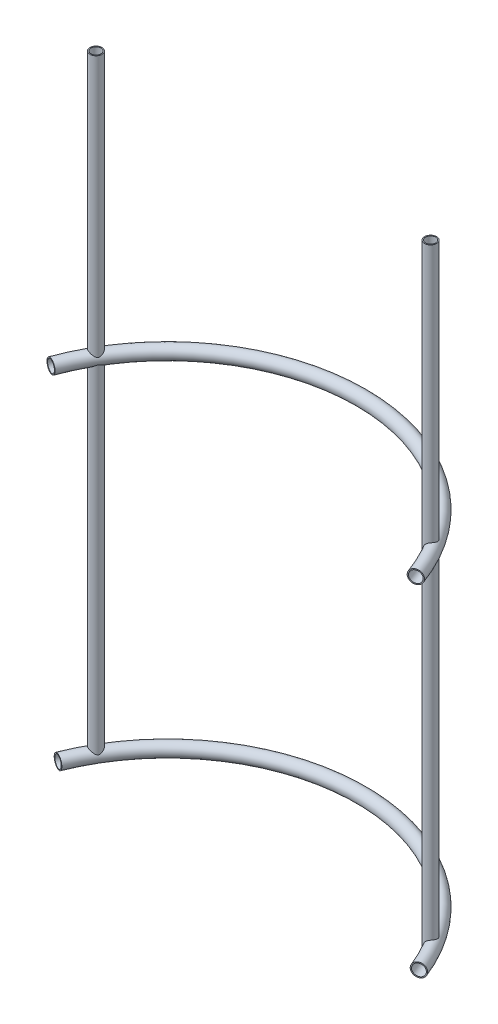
ISO-10303-21;
HEADER;
FILE_DESCRIPTION(('STEP AP214'),'2;1');
FILE_NAME('part.step','',(''),(''),'','','');
FILE_SCHEMA(('AUTOMOTIVE_DESIGN { 1 0 10303 214 1 1 1 1 }'));
ENDSEC;
DATA;
#1=APPLICATION_CONTEXT('core data for automotive mechanical design processes');
#2=APPLICATION_PROTOCOL_DEFINITION('international standard','automotive_design',2000,#1);
#3=PRODUCT_CONTEXT('',#1,'mechanical');
#4=PRODUCT('Part','Part','',(#3));
#5=PRODUCT_RELATED_PRODUCT_CATEGORY('part','',(#4));
#6=PRODUCT_DEFINITION_FORMATION('','',#4);
#7=PRODUCT_DEFINITION_CONTEXT('part definition',#1,'design');
#8=PRODUCT_DEFINITION('design','',#6,#7);
#9=PRODUCT_DEFINITION_SHAPE('','',#8);
#10=(LENGTH_UNIT() NAMED_UNIT(*) SI_UNIT(.MILLI.,.METRE.));
#11=(NAMED_UNIT(*) PLANE_ANGLE_UNIT() SI_UNIT($,.RADIAN.));
#12=(NAMED_UNIT(*) SI_UNIT($,.STERADIAN.) SOLID_ANGLE_UNIT());
#13=UNCERTAINTY_MEASURE_WITH_UNIT(LENGTH_MEASURE(1.E-05),#10,'distance_accuracy_value','');
#14=(GEOMETRIC_REPRESENTATION_CONTEXT(3) GLOBAL_UNCERTAINTY_ASSIGNED_CONTEXT((#13)) GLOBAL_UNIT_ASSIGNED_CONTEXT((#10,
#11,#12)) REPRESENTATION_CONTEXT('',''));
#15=CARTESIAN_POINT('',(0.,0.,0.));
#16=DIRECTION('',(0.,0.,1.));
#17=DIRECTION('',(1.,0.,0.));
#18=AXIS2_PLACEMENT_3D('',#15,#16,#17);
#19=CARTESIAN_POINT('',(0.,858.,0.));
#20=DIRECTION('',(0.,-1.,0.));
#21=DIRECTION('',(0.,0.,-1.));
#22=AXIS2_PLACEMENT_3D('',#19,#20,#21);
#23=TOROIDAL_SURFACE('',#22,484.,14.3499999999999);
#24=CARTESIAN_POINT('',(-454.81122846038,858.,-165.537749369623));
#25=DIRECTION('',(0.342020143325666,0.,-0.939692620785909));
#26=DIRECTION('',(-0.939692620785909,0.,-0.342020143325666));
#27=AXIS2_PLACEMENT_3D('',#24,#25,#26);
#28=CIRCLE('',#27,14.3499999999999);
#29=CARTESIAN_POINT('',(-468.295817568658,858.,-170.445738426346));
#30=VERTEX_POINT('',#29);
#31=EDGE_CURVE('E45',#30,#30,#28,.T.);
#32=CARTESIAN_POINT('',(454.81122846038,858.,-165.537749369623));
#33=DIRECTION('',(0.342020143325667,0.,0.939692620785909));
#34=DIRECTION('',(0.939692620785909,0.,-0.342020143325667));
#35=AXIS2_PLACEMENT_3D('',#32,#33,#34);
#36=CIRCLE('',#35,14.3499999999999);
#37=CARTESIAN_POINT('',(468.295817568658,858.,-170.445738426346));
#38=VERTEX_POINT('',#37);
#39=EDGE_CURVE('E53',#38,#38,#36,.T.);
#40=CARTESIAN_POINT('',(0.,858.,0.));
#41=DIRECTION('',(0.,-1.,0.));
#42=DIRECTION('',(0.,0.,-1.));
#43=AXIS2_PLACEMENT_3D('',#40,#41,#42);
#44=CIRCLE('',#43,498.35);
#45=EDGE_CURVE('',#30,#38,#44,.T.);
#46=ORIENTED_EDGE('',*,*,#31,.F.);
#47=ORIENTED_EDGE('',*,*,#39,.T.);
#48=ORIENTED_EDGE('',*,*,#45,.T.);
#49=ORIENTED_EDGE('',*,*,#45,.F.);
#50=EDGE_LOOP('',(#46,#48,#47,#49));
#51=FACE_BOUND('',#50,.T.);
#52=ADVANCED_FACE('F38',(#51),#23,.F.);
#53=CARTESIAN_POINT('',(0.,858.,0.));
#54=DIRECTION('',(0.,-1.,0.));
#55=DIRECTION('',(0.,0.,-1.));
#56=AXIS2_PLACEMENT_3D('',#53,#54,#55);
#57=TOROIDAL_SURFACE('',#56,484.,16.8500000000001);
#58=CARTESIAN_POINT('',(-454.81122846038,858.,-165.537749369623));
#59=DIRECTION('',(0.342020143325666,0.,-0.939692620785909));
#60=DIRECTION('',(-0.939692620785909,0.,-0.342020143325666));
#61=AXIS2_PLACEMENT_3D('',#58,#59,#60);
#62=CIRCLE('',#61,16.8500000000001);
#63=CARTESIAN_POINT('',(-470.645049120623,858.,-171.30078878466));
#64=VERTEX_POINT('',#63);
#65=EDGE_CURVE('E11',#64,#64,#62,.T.);
#66=CARTESIAN_POINT('',(454.81122846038,858.,-165.537749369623));
#67=DIRECTION('',(0.342020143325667,0.,0.939692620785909));
#68=DIRECTION('',(0.939692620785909,0.,-0.342020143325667));
#69=AXIS2_PLACEMENT_3D('',#66,#67,#68);
#70=CIRCLE('',#69,16.8500000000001);
#71=CARTESIAN_POINT('',(470.645049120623,858.,-171.30078878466));
#72=VERTEX_POINT('',#71);
#73=EDGE_CURVE('E49',#72,#72,#70,.T.);
#74=CARTESIAN_POINT('',(0.,858.,0.));
#75=DIRECTION('',(0.,-1.,0.));
#76=DIRECTION('',(0.,0.,-1.));
#77=AXIS2_PLACEMENT_3D('',#74,#75,#76);
#78=CIRCLE('',#77,500.85);
#79=EDGE_CURVE('',#64,#72,#78,.T.);
#80=ORIENTED_EDGE('',*,*,#65,.T.);
#81=ORIENTED_EDGE('',*,*,#73,.F.);
#82=ORIENTED_EDGE('',*,*,#79,.T.);
#83=ORIENTED_EDGE('',*,*,#79,.F.);
#84=EDGE_LOOP('',(#80,#82,#81,#83));
#85=FACE_BOUND('',#84,.T.);
#86=ADVANCED_FACE('F40',(#85),#57,.T.);
#87=CARTESIAN_POINT('',(-454.81122846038,858.,-165.537749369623));
#88=DIRECTION('',(0.342020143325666,0.,-0.939692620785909));
#89=DIRECTION('',(-0.939692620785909,0.,-0.342020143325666));
#90=AXIS2_PLACEMENT_3D('',#87,#88,#89);
#91=PLANE('',#90);
#92=ORIENTED_EDGE('',*,*,#31,.T.);
#93=EDGE_LOOP('',(#92));
#94=FACE_BOUND('',#93,.T.);
#95=ORIENTED_EDGE('',*,*,#65,.F.);
#96=EDGE_LOOP('',(#95));
#97=FACE_BOUND('',#96,.T.);
#98=ADVANCED_FACE('F63',(#94,#97),#91,.F.);
#99=CARTESIAN_POINT('',(454.81122846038,858.,-165.537749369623));
#100=DIRECTION('',(0.342020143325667,0.,0.939692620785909));
#101=DIRECTION('',(0.939692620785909,0.,-0.342020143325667));
#102=AXIS2_PLACEMENT_3D('',#99,#100,#101);
#103=PLANE('',#102);
#104=ORIENTED_EDGE('',*,*,#39,.F.);
#105=EDGE_LOOP('',(#104));
#106=FACE_BOUND('',#105,.T.);
#107=ORIENTED_EDGE('',*,*,#73,.T.);
#108=EDGE_LOOP('',(#107));
#109=FACE_BOUND('',#108,.T.);
#110=ADVANCED_FACE('F60',(#106,#109),#103,.T.);
#111=CLOSED_SHELL('',(#52,#86,#98,#110));
#112=MANIFOLD_SOLID_BREP('B2',#111);
#113=CARTESIAN_POINT('',(-419.16,-16.8509999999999,-242.));
#114=DIRECTION('',(0.,1.,0.));
#115=DIRECTION('',(0.,0.,1.));
#116=AXIS2_PLACEMENT_3D('',#113,#114,#115);
#117=CYLINDRICAL_SURFACE('',#116,15.);
#118=CARTESIAN_POINT('',(-419.16,1518.,-242.));
#119=DIRECTION('',(0.,1.,0.));
#120=DIRECTION('',(0.,0.,-1.));
#121=AXIS2_PLACEMENT_3D('',#118,#119,#120);
#122=CIRCLE('',#121,15.);
#123=CARTESIAN_POINT('',(-419.16,1518.,-257.));
#124=VERTEX_POINT('',#123);
#125=EDGE_CURVE('E124',#124,#124,#122,.T.);
#126=ORIENTED_EDGE('',*,*,#125,.F.);
#127=EDGE_LOOP('',(#126));
#128=FACE_BOUND('',#127,.T.);
#129=CARTESIAN_POINT('',(-431.764446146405,7.70440829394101,-250.131908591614));
#130=CARTESIAN_POINT('',(-431.879969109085,7.68455783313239,-249.952854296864));
#131=CARTESIAN_POINT('',(-431.992075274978,7.67314875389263,-249.770692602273));
#132=CARTESIAN_POINT('',(-432.208477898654,7.66776179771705,-249.401550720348));
#133=CARTESIAN_POINT('',(-432.312775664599,7.67378099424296,-249.214571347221));
#134=CARTESIAN_POINT('',(-432.512927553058,7.70296475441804,-248.837037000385));
#135=CARTESIAN_POINT('',(-432.608765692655,7.72616102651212,-248.646476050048));
#136=CARTESIAN_POINT('',(-432.791296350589,7.78855174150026,-248.263606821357));
#137=CARTESIAN_POINT('',(-432.877987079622,7.8277493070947,-248.071298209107));
#138=CARTESIAN_POINT('',(-433.067781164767,7.93493701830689,-247.625762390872));
#139=CARTESIAN_POINT('',(-433.167507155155,8.00810149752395,-247.372341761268));
#140=CARTESIAN_POINT('',(-433.351261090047,8.1745243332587,-246.866284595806));
#141=CARTESIAN_POINT('',(-433.435274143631,8.26780157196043,-246.61364902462));
#142=CARTESIAN_POINT('',(-433.588524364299,8.47032239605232,-246.109421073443));
#143=CARTESIAN_POINT('',(-433.657715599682,8.5796138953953,-245.857834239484));
#144=CARTESIAN_POINT('',(-433.781848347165,8.81014284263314,-245.356803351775));
#145=CARTESIAN_POINT('',(-433.836793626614,8.93137712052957,-245.107358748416));
#146=CARTESIAN_POINT('',(-433.9710254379,9.280988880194,-244.41603834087));
#147=CARTESIAN_POINT('',(-434.035754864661,9.51902591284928,-243.976195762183));
#148=CARTESIAN_POINT('',(-434.126002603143,10.0105532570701,-243.101061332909));
#149=CARTESIAN_POINT('',(-434.15149204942,10.2640548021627,-242.665773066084));
#150=CARTESIAN_POINT('',(-434.164921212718,10.7782469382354,-241.798114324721));
#151=CARTESIAN_POINT('',(-434.15281032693,11.0389467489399,-241.365748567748));
#152=CARTESIAN_POINT('',(-434.091469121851,11.56079116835,-240.504110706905));
#153=CARTESIAN_POINT('',(-434.042248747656,11.8219356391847,-240.074837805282));
#154=CARTESIAN_POINT('',(-433.902162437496,12.3557392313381,-239.192828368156));
#155=CARTESIAN_POINT('',(-433.808899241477,12.6281058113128,-238.740290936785));
#156=CARTESIAN_POINT('',(-433.579034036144,13.1622805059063,-237.839786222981));
#157=CARTESIAN_POINT('',(-433.442422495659,13.4240862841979,-237.39181996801));
#158=CARTESIAN_POINT('',(-433.124745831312,13.9311376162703,-236.503850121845));
#159=CARTESIAN_POINT('',(-432.943793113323,14.1764230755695,-236.06382937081));
#160=CARTESIAN_POINT('',(-432.535682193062,14.6456151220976,-235.194000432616));
#161=CARTESIAN_POINT('',(-432.30854821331,14.8695328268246,-234.764187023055));
#162=CARTESIAN_POINT('',(-431.886556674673,15.2233991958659,-234.053479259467));
#163=CARTESIAN_POINT('',(-431.704354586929,15.3606078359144,-233.768638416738));
#164=CARTESIAN_POINT('',(-431.317692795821,15.6204575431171,-233.20758834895));
#165=CARTESIAN_POINT('',(-431.113239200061,15.7431025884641,-232.931376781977));
#166=CARTESIAN_POINT('',(-430.682220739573,15.9718420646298,-232.38968372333));
#167=CARTESIAN_POINT('',(-430.455663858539,16.0779424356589,-232.124198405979));
#168=CARTESIAN_POINT('',(-429.980859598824,16.2717142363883,-231.606134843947));
#169=CARTESIAN_POINT('',(-429.732611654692,16.3593851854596,-231.353556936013));
#170=CARTESIAN_POINT('',(-429.213353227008,16.5151041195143,-230.861825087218));
#171=CARTESIAN_POINT('',(-428.942176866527,16.5829898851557,-230.62279439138));
#172=CARTESIAN_POINT('',(-428.380393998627,16.6966044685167,-230.16293627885));
#173=CARTESIAN_POINT('',(-428.089787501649,16.7423332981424,-229.942108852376));
#174=CARTESIAN_POINT('',(-427.491517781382,16.810434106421,-229.5212381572));
#175=CARTESIAN_POINT('',(-427.183864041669,16.8328189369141,-229.321183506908));
#176=CARTESIAN_POINT('',(-426.554110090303,16.8536230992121,-228.943897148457));
#177=CARTESIAN_POINT('',(-426.232011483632,16.8520450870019,-228.766662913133));
#178=CARTESIAN_POINT('',(-425.615860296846,16.8265302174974,-228.456507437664));
#179=CARTESIAN_POINT('',(-425.323079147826,16.8052985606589,-228.320820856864));
#180=CARTESIAN_POINT('',(-424.731021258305,16.7446344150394,-228.06920109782));
#181=CARTESIAN_POINT('',(-424.431745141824,16.7052036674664,-227.953266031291));
#182=CARTESIAN_POINT('',(-423.828918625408,16.6088401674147,-227.741554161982));
#183=CARTESIAN_POINT('',(-423.52536801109,16.5519065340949,-227.645778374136));
#184=CARTESIAN_POINT('',(-422.916127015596,16.421515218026,-227.474448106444));
#185=CARTESIAN_POINT('',(-422.610436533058,16.3480567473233,-227.398894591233));
#186=CARTESIAN_POINT('',(-421.995910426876,16.1850149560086,-227.267134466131));
#187=CARTESIAN_POINT('',(-421.687072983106,16.0952825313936,-227.21112207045));
#188=CARTESIAN_POINT('',(-421.07096024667,15.9015358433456,-227.118962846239));
#189=CARTESIAN_POINT('',(-420.763684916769,15.7975219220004,-227.082815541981));
#190=CARTESIAN_POINT('',(-420.152090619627,15.5766069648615,-227.029696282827));
#191=CARTESIAN_POINT('',(-419.847772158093,15.4597037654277,-227.012727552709));
#192=CARTESIAN_POINT('',(-419.243287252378,15.2144425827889,-226.997182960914));
#193=CARTESIAN_POINT('',(-418.943121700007,15.0860821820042,-226.998610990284));
#194=CARTESIAN_POINT('',(-418.202269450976,14.7540441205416,-227.024039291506));
#195=CARTESIAN_POINT('',(-417.76466284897,14.5442362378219,-227.058738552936));
#196=CARTESIAN_POINT('',(-416.902907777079,14.1067856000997,-227.164428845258));
#197=CARTESIAN_POINT('',(-416.478765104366,13.8791353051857,-227.235435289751));
#198=CARTESIAN_POINT('',(-415.644230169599,13.4096895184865,-227.411589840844));
#199=CARTESIAN_POINT('',(-415.233876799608,13.1678585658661,-227.516826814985));
#200=CARTESIAN_POINT('',(-414.428785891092,12.6748176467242,-227.759480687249));
#201=CARTESIAN_POINT('',(-414.034045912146,12.4236091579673,-227.896892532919));
#202=CARTESIAN_POINT('',(-413.251112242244,11.9100699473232,-228.206291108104));
#203=CARTESIAN_POINT('',(-412.8632908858,11.6476165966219,-228.379015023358));
#204=CARTESIAN_POINT('',(-412.103674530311,11.1223415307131,-228.756576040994));
#205=CARTESIAN_POINT('',(-411.731885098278,10.8595197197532,-228.961424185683));
#206=CARTESIAN_POINT('',(-411.004686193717,10.3403527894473,-229.40350705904));
#207=CARTESIAN_POINT('',(-410.649242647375,10.0839947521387,-229.640669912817));
#208=CARTESIAN_POINT('',(-410.127554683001,9.71050312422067,-230.022469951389));
#209=CARTESIAN_POINT('',(-409.955612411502,9.58787558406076,-230.154043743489));
#210=CARTESIAN_POINT('',(-409.615472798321,9.34772660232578,-230.426344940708));
#211=CARTESIAN_POINT('',(-409.447274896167,9.23020439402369,-230.567070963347));
#212=CARTESIAN_POINT('',(-409.121086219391,9.00641917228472,-230.852565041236));
#213=CARTESIAN_POINT('',(-408.962952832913,8.89989606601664,-230.996963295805));
#214=CARTESIAN_POINT('',(-408.650311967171,8.69510031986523,-231.295178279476));
#215=CARTESIAN_POINT('',(-408.495805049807,8.59682895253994,-231.448996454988));
#216=CARTESIAN_POINT('',(-408.038372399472,8.31802096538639,-231.925150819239));
#217=CARTESIAN_POINT('',(-407.740878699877,8.15302341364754,-232.262754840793));
#218=CARTESIAN_POINT('',(-407.33332587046,7.96505911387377,-232.771396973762));
#219=CARTESIAN_POINT('',(-407.214477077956,7.91517137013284,-232.925693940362));
#220=CARTESIAN_POINT('',(-406.981241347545,7.82880782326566,-233.241217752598));
#221=CARTESIAN_POINT('',(-406.866852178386,7.79232523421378,-233.402441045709));
#222=CARTESIAN_POINT('',(-406.643547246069,7.73437726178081,-233.730913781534));
#223=CARTESIAN_POINT('',(-406.534623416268,7.71288910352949,-233.89815367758));
#224=CARTESIAN_POINT('',(-406.323008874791,7.68589080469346,-234.237804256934));
#225=CARTESIAN_POINT('',(-406.220318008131,7.6803802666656,-234.410214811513));
#226=CARTESIAN_POINT('',(-406.021878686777,7.68562796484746,-234.759135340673));
#227=CARTESIAN_POINT('',(-405.926142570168,7.696414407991,-234.935651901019));
#228=CARTESIAN_POINT('',(-405.742477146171,7.73375218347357,-235.291043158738));
#229=CARTESIAN_POINT('',(-405.654548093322,7.76030402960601,-235.46991793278));
#230=CARTESIAN_POINT('',(-405.486728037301,7.82796815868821,-235.829020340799));
#231=CARTESIAN_POINT('',(-405.406850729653,7.8691047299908,-236.009249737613));
#232=CARTESIAN_POINT('',(-405.255351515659,7.96423820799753,-236.369811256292));
#233=CARTESIAN_POINT('',(-405.183732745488,8.01823997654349,-236.550143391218));
#234=CARTESIAN_POINT('',(-405.010332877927,8.17096983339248,-237.012247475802));
#235=CARTESIAN_POINT('',(-404.914456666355,8.27770249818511,-237.293596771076));
#236=CARTESIAN_POINT('',(-404.741477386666,8.51139085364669,-237.853645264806));
#237=CARTESIAN_POINT('',(-404.664387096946,8.63836021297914,-238.132342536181));
#238=CARTESIAN_POINT('',(-404.527428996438,8.9073784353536,-238.687900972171));
#239=CARTESIAN_POINT('',(-404.467625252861,9.04948078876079,-238.964751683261));
#240=CARTESIAN_POINT('',(-404.364463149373,9.34398739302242,-239.515912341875));
#241=CARTESIAN_POINT('',(-404.321102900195,9.49639045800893,-239.790222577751));
#242=CARTESIAN_POINT('',(-404.253969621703,9.79053440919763,-240.305898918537));
#243=CARTESIAN_POINT('',(-404.228534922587,9.93152926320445,-240.5474791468));
#244=CARTESIAN_POINT('',(-404.189482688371,10.2172261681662,-241.029413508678));
#245=CARTESIAN_POINT('',(-404.175866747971,10.3619287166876,-241.269767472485));
#246=CARTESIAN_POINT('',(-404.152309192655,10.7994666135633,-241.989661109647));
#247=CARTESIAN_POINT('',(-404.159681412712,11.0956244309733,-242.467848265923));
#248=CARTESIAN_POINT('',(-404.219855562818,11.6871934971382,-243.421245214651));
#249=CARTESIAN_POINT('',(-404.272625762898,11.9826051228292,-243.896456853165));
#250=CARTESIAN_POINT('',(-404.424290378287,12.5656808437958,-244.844102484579));
#251=CARTESIAN_POINT('',(-404.523162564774,12.8533486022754,-245.316537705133));
#252=CARTESIAN_POINT('',(-404.742343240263,13.354401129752,-246.156564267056));
#253=CARTESIAN_POINT('',(-404.853521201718,13.5704967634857,-246.524933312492));
#254=CARTESIAN_POINT('',(-405.106398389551,13.9908993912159,-247.2580028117));
#255=CARTESIAN_POINT('',(-405.248097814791,14.1952063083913,-247.622703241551));
#256=CARTESIAN_POINT('',(-405.562822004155,14.5885000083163,-248.346027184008));
#257=CARTESIAN_POINT('',(-405.73579720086,14.7775103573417,-248.704659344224));
#258=CARTESIAN_POINT('',(-406.114134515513,15.1372022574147,-249.413962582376));
#259=CARTESIAN_POINT('',(-406.319489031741,15.3078880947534,-249.76463550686));
#260=CARTESIAN_POINT('',(-406.717935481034,15.5949161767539,-250.384616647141));
#261=CARTESIAN_POINT('',(-406.90501033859,15.715247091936,-250.655953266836));
#262=CARTESIAN_POINT('',(-407.30002717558,15.9403068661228,-251.189734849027));
#263=CARTESIAN_POINT('',(-407.507964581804,16.0450391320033,-251.452181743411));
#264=CARTESIAN_POINT('',(-407.944329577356,16.237162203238,-251.966057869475));
#265=CARTESIAN_POINT('',(-408.172750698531,16.3245584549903,-252.217490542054));
#266=CARTESIAN_POINT('',(-408.649378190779,16.4804560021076,-252.707172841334));
#267=CARTESIAN_POINT('',(-408.897584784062,16.5489570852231,-252.945422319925));
#268=CARTESIAN_POINT('',(-409.414112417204,16.6660644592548,-253.407828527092));
#269=CARTESIAN_POINT('',(-409.682548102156,16.7145454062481,-253.631889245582));
#270=CARTESIAN_POINT('',(-410.236370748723,16.7899772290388,-254.061996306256));
#271=CARTESIAN_POINT('',(-410.521757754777,16.8169280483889,-254.268042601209));
#272=CARTESIAN_POINT('',(-411.107122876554,16.8487326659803,-254.65998448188));
#273=CARTESIAN_POINT('',(-411.407097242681,16.8535921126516,-254.845885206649));
#274=CARTESIAN_POINT('',(-412.019051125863,16.8411827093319,-255.195873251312));
#275=CARTESIAN_POINT('',(-412.331029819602,16.8239153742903,-255.35996206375));
#276=CARTESIAN_POINT('',(-412.933182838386,16.7704871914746,-255.650176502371));
#277=CARTESIAN_POINT('',(-413.222509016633,16.7363373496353,-255.77844493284));
#278=CARTESIAN_POINT('',(-413.806493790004,16.6511065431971,-256.015680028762));
#279=CARTESIAN_POINT('',(-414.10115196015,16.6000269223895,-256.124648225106));
#280=CARTESIAN_POINT('',(-414.693810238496,16.4818626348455,-256.323087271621));
#281=CARTESIAN_POINT('',(-414.991810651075,16.4147764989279,-256.412556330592));
#282=CARTESIAN_POINT('',(-415.589271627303,16.2657186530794,-256.572080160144));
#283=CARTESIAN_POINT('',(-415.888732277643,16.1837460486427,-256.642133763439));
#284=CARTESIAN_POINT('',(-416.503383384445,16.0014233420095,-256.766376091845));
#285=CARTESIAN_POINT('',(-416.818562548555,15.9003272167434,-256.819521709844));
#286=CARTESIAN_POINT('',(-417.447131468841,15.6844710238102,-256.905259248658));
#287=CARTESIAN_POINT('',(-417.760520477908,15.5697056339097,-256.937843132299));
#288=CARTESIAN_POINT('',(-418.384032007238,15.3280617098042,-256.983176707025));
#289=CARTESIAN_POINT('',(-418.694154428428,15.2011828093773,-256.995925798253));
#290=CARTESIAN_POINT('',(-419.310060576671,14.9367977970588,-257.002412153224));
#291=CARTESIAN_POINT('',(-419.615843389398,14.7992894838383,-256.996145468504));
#292=CARTESIAN_POINT('',(-420.375809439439,14.4430845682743,-256.957639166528));
#293=CARTESIAN_POINT('',(-420.826707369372,14.2185441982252,-256.913851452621));
#294=CARTESIAN_POINT('',(-421.714605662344,13.7532940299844,-256.787672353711));
#295=CARTESIAN_POINT('',(-422.151599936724,13.5125772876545,-256.705264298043));
#296=CARTESIAN_POINT('',(-423.011490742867,13.0188424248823,-256.503845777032));
#297=CARTESIAN_POINT('',(-423.434346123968,12.765792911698,-256.384737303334));
#298=CARTESIAN_POINT('',(-424.263994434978,12.2525433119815,-256.11169630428));
#299=CARTESIAN_POINT('',(-424.67079016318,11.9923444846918,-255.95776987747));
#300=CARTESIAN_POINT('',(-425.476344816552,11.4642136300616,-255.612485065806));
#301=CARTESIAN_POINT('',(-425.874772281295,11.1962319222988,-255.420429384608));
#302=CARTESIAN_POINT('',(-426.655102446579,10.6636338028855,-255.000764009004));
#303=CARTESIAN_POINT('',(-427.036997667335,10.3990189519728,-254.773138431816));
#304=CARTESIAN_POINT('',(-427.784246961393,9.88110911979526,-254.2809815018));
#305=CARTESIAN_POINT('',(-428.149610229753,9.62780784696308,-254.016471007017));
#306=CARTESIAN_POINT('',(-428.685097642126,9.26493837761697,-253.589841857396));
#307=CARTESIAN_POINT('',(-428.86145560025,9.14685790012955,-253.442697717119));
#308=CARTESIAN_POINT('',(-429.209931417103,8.91831895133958,-253.137884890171));
#309=CARTESIAN_POINT('',(-429.382050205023,8.80785879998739,-252.980218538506));
#310=CARTESIAN_POINT('',(-429.752531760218,8.5778027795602,-252.624294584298));
#311=CARTESIAN_POINT('',(-429.950023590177,8.46015699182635,-252.42384720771));
#312=CARTESIAN_POINT('',(-430.338024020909,8.24344186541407,-252.006641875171));
#313=CARTESIAN_POINT('',(-430.528532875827,8.14437185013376,-251.789884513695));
#314=CARTESIAN_POINT('',(-430.899720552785,7.9710566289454,-251.341467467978));
#315=CARTESIAN_POINT('',(-431.080461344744,7.89663427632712,-251.109929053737));
#316=CARTESIAN_POINT('',(-431.431217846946,7.7773432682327,-250.631622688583));
#317=CARTESIAN_POINT('',(-431.601241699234,7.73245192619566,-250.384866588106));
#318=CARTESIAN_POINT('',(-431.764446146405,7.70440829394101,-250.131908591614));
#319=B_SPLINE_CURVE_WITH_KNOTS('',3,(#129,#130,#131,#132,#133,#134,#135,#136,#137,#138,#139,
#140,#141,#142,#143,#144,#145,#146,#147,#148,#149,#150,#151,#152,#153,#154,#155,#156,#157,#158,
#159,#160,#161,#162,#163,#164,#165,#166,#167,#168,#169,#170,#171,#172,#173,#174,#175,#176,#177,
#178,#179,#180,#181,#182,#183,#184,#185,#186,#187,#188,#189,#190,#191,#192,#193,#194,#195,#196,
#197,#198,#199,#200,#201,#202,#203,#204,#205,#206,#207,#208,#209,#210,#211,#212,#213,#214,#215,
#216,#217,#218,#219,#220,#221,#222,#223,#224,#225,#226,#227,#228,#229,#230,#231,#232,#233,#234,
#235,#236,#237,#238,#239,#240,#241,#242,#243,#244,#245,#246,#247,#248,#249,#250,#251,#252,#253,
#254,#255,#256,#257,#258,#259,#260,#261,#262,#263,#264,#265,#266,#267,#268,#269,#270,#271,#272,
#273,#274,#275,#276,#277,#278,#279,#280,#281,#282,#283,#284,#285,#286,#287,#288,#289,#290,#291,
#292,#293,#294,#295,#296,#297,#298,#299,#300,#301,#302,#303,#304,#305,#306,#307,#308,#309,#310,
#311,#312,#313,#314,#315,#316,#317,#318),.UNSPECIFIED.,.T.,.F.,(4,2,2,2,2,2,2,2,2,2,2,2,2,2,2,2,
2,2,2,2,2,2,2,2,2,2,2,2,2,2,2,2,2,2,2,2,2,2,2,2,2,2,2,2,2,2,2,2,2,2,2,2,2,2,2,2,2,2,2,2,2,2,2,2,
2,2,2,2,2,2,2,2,2,2,2,2,2,2,2,2,2,2,2,2,2,2,2,2,2,2,2,2,2,2,4),(0.,0.64174862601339,
1.28338949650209,1.92621778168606,2.56917157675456,3.41373483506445,4.25909446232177,
5.10703706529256,5.95475520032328,7.46527339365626,8.97690221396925,10.4905662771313,
12.0038248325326,13.6110944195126,15.2187176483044,16.8223069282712,18.4250572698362,
19.5188383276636,20.6123199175,21.7054079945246,22.7985245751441,23.9003665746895,
25.0022079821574,26.1034424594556,27.2045548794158,28.1735621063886,29.1424766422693,
30.1114399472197,31.0804494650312,32.0588323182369,33.0371917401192,34.0157156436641,
34.9944465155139,36.4518985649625,37.909969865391,39.3718571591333,40.8335150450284,
42.3295510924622,43.8261025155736,45.3193780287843,46.0656492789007,46.8118080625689,
47.5289603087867,48.2462229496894,49.677806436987,50.2804769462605,50.8828419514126,
51.4842900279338,52.0857231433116,52.6881984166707,53.2906933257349,53.8941963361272,
54.4979277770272,55.4437652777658,56.3902443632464,57.340187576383,58.2900216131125,
59.1323319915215,59.9747560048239,61.6602462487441,63.3445594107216,65.028061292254,
66.3508923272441,67.6737319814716,68.994493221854,70.3149448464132,71.3665305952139,
72.4178863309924,73.4689112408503,74.5199479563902,75.5774688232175,76.6349924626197,
77.6922456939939,78.7494265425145,79.7033071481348,80.6571120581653,81.6110045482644,
82.5649543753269,83.5696881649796,84.5748144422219,85.5799711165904,86.5853365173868,
88.0999438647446,89.6152056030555,91.1345494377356,92.6536273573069,94.2035844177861,
95.7542355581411,97.3040133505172,98.0784931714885,98.8528016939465,99.7668794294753,
100.680923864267,101.588248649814,102.494875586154),.UNSPECIFIED.);
#320=CARTESIAN_POINT('',(-431.764446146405,7.70440829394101,-250.131908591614));
#321=VERTEX_POINT('',#320);
#322=EDGE_CURVE('E37',#321,#321,#319,.T.);
#323=ORIENTED_EDGE('',*,*,#322,.T.);
#324=EDGE_LOOP('',(#323));
#325=FACE_BOUND('',#324,.T.);
#326=ADVANCED_FACE('F108',(#128,#325),#117,.T.);
#327=CARTESIAN_POINT('',(-419.16,1518.,-242.));
#328=DIRECTION('',(0.,-1.,0.));
#329=DIRECTION('',(0.,0.,-1.));
#330=AXIS2_PLACEMENT_3D('',#327,#328,#329);
#331=PLANE('',#330);
#332=CARTESIAN_POINT('',(-419.16,1518.,-242.));
#333=DIRECTION('',(0.,1.,0.));
#334=DIRECTION('',(0.,0.,-1.));
#335=AXIS2_PLACEMENT_3D('',#332,#333,#334);
#336=CIRCLE('',#335,12.5);
#337=CARTESIAN_POINT('',(-419.16,1518.,-254.5));
#338=VERTEX_POINT('',#337);
#339=EDGE_CURVE('E128',#338,#338,#336,.T.);
#340=ORIENTED_EDGE('',*,*,#339,.F.);
#341=EDGE_LOOP('',(#340));
#342=FACE_BOUND('',#341,.T.);
#343=ORIENTED_EDGE('',*,*,#125,.T.);
#344=EDGE_LOOP('',(#343));
#345=FACE_BOUND('',#344,.T.);
#346=ADVANCED_FACE('F137',(#342,#345),#331,.F.);
#347=CARTESIAN_POINT('',(-419.16,-16.8509999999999,-242.));
#348=DIRECTION('',(0.,1.,0.));
#349=DIRECTION('',(0.,0.,1.));
#350=AXIS2_PLACEMENT_3D('',#347,#348,#349);
#351=CYLINDRICAL_SURFACE('',#350,12.5);
#352=ORIENTED_EDGE('',*,*,#339,.T.);
#353=EDGE_LOOP('',(#352));
#354=FACE_BOUND('',#353,.T.);
#355=CARTESIAN_POINT('',(-431.025279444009,11.5681234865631,-245.932574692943));
#356=CARTESIAN_POINT('',(-431.13549253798,11.6412812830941,-245.600030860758));
#357=CARTESIAN_POINT('',(-431.230874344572,11.7275173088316,-245.265369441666));
#358=CARTESIAN_POINT('',(-431.39254301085,11.9208698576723,-244.594997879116));
#359=CARTESIAN_POINT('',(-431.458808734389,12.0280014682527,-244.259287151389));
#360=CARTESIAN_POINT('',(-431.563395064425,12.2582412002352,-243.587936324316));
#361=CARTESIAN_POINT('',(-431.60163190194,12.3813959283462,-243.252299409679));
#362=CARTESIAN_POINT('',(-431.650881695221,12.6386934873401,-242.583392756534));
#363=CARTESIAN_POINT('',(-431.661899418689,12.7728343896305,-242.250122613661));
#364=CARTESIAN_POINT('',(-431.657593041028,13.046439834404,-241.590529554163));
#365=CARTESIAN_POINT('',(-431.642573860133,13.1858243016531,-241.264170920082));
#366=CARTESIAN_POINT('',(-431.587312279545,13.467942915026,-240.615080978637));
#367=CARTESIAN_POINT('',(-431.547070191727,13.6106770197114,-240.292349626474));
#368=CARTESIAN_POINT('',(-431.441647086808,13.8964306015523,-239.651249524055));
#369=CARTESIAN_POINT('',(-431.376474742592,14.0394499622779,-239.332879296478));
#370=CARTESIAN_POINT('',(-431.221233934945,14.3230863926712,-238.701145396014));
#371=CARTESIAN_POINT('',(-431.131163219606,14.4637032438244,-238.387782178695));
#372=CARTESIAN_POINT('',(-430.908160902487,14.7639841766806,-237.713047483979));
#373=CARTESIAN_POINT('',(-430.770499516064,14.9227078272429,-237.35280450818));
#374=CARTESIAN_POINT('',(-430.460393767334,15.2292570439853,-236.642648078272));
#375=CARTESIAN_POINT('',(-430.287942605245,15.3770804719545,-236.292736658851));
#376=CARTESIAN_POINT('',(-429.908359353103,15.6576118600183,-235.606543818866));
#377=CARTESIAN_POINT('',(-429.701276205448,15.7903407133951,-235.27024398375));
#378=CARTESIAN_POINT('',(-429.252514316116,16.0369318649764,-234.614279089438));
#379=CARTESIAN_POINT('',(-429.010852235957,16.1508031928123,-234.29460611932));
#380=CARTESIAN_POINT('',(-428.568330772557,16.3263982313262,-233.764965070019));
#381=CARTESIAN_POINT('',(-428.375738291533,16.3936991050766,-233.549897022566));
#382=CARTESIAN_POINT('',(-427.974160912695,16.5155741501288,-233.131825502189));
#383=CARTESIAN_POINT('',(-427.765179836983,16.5701512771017,-232.928819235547));
#384=CARTESIAN_POINT('',(-427.331914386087,16.6654391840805,-232.536642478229));
#385=CARTESIAN_POINT('',(-427.107641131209,16.7061599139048,-232.347462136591));
#386=CARTESIAN_POINT('',(-426.644933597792,16.7728966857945,-231.984400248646));
#387=CARTESIAN_POINT('',(-426.40649885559,16.7989122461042,-231.810519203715));
#388=CARTESIAN_POINT('',(-425.916334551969,16.8356756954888,-231.479081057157));
#389=CARTESIAN_POINT('',(-425.664566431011,16.8463764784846,-231.321575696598));
#390=CARTESIAN_POINT('',(-425.150313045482,16.8520719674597,-231.024833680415));
#391=CARTESIAN_POINT('',(-424.887827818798,16.8470667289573,-230.885596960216));
#392=CARTESIAN_POINT('',(-424.354194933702,16.8214218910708,-230.626419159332));
#393=CARTESIAN_POINT('',(-424.083045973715,16.8007799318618,-230.506480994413));
#394=CARTESIAN_POINT('',(-423.534303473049,16.7442875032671,-230.286638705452));
#395=CARTESIAN_POINT('',(-423.25671002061,16.708437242,-230.186734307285));
#396=CARTESIAN_POINT('',(-422.70923990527,16.6241296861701,-230.011173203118));
#397=CARTESIAN_POINT('',(-422.439542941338,16.5762790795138,-229.934660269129));
#398=CARTESIAN_POINT('',(-421.897999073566,16.468221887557,-229.800361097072));
#399=CARTESIAN_POINT('',(-421.626152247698,16.4080157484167,-229.742574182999));
#400=CARTESIAN_POINT('',(-421.081930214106,16.2763017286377,-229.645543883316));
#401=CARTESIAN_POINT('',(-420.80955504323,16.2047946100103,-229.606299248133));
#402=CARTESIAN_POINT('',(-420.265571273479,16.0516162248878,-229.545978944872));
#403=CARTESIAN_POINT('',(-419.993962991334,15.9699412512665,-229.524909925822));
#404=CARTESIAN_POINT('',(-419.425925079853,15.7891277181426,-229.499282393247));
#405=CARTESIAN_POINT('',(-419.129708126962,15.689060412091,-229.496570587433));
#406=CARTESIAN_POINT('',(-418.540946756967,15.4798200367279,-229.511863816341));
#407=CARTESIAN_POINT('',(-418.248403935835,15.3706431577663,-229.529877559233));
#408=CARTESIAN_POINT('',(-417.667945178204,15.144874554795,-229.585941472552));
#409=CARTESIAN_POINT('',(-417.380032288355,15.0282781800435,-229.62400432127));
#410=CARTESIAN_POINT('',(-416.809899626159,14.7895230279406,-229.719504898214));
#411=CARTESIAN_POINT('',(-416.527678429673,14.6673656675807,-229.776937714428));
#412=CARTESIAN_POINT('',(-415.914817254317,14.3949554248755,-229.923718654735));
#413=CARTESIAN_POINT('',(-415.585506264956,14.2438813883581,-230.017112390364));
#414=CARTESIAN_POINT('',(-414.936529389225,13.9394443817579,-230.230166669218));
#415=CARTESIAN_POINT('',(-414.616865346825,13.7860809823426,-230.349832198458));
#416=CARTESIAN_POINT('',(-413.987720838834,13.4804428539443,-230.615178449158));
#417=CARTESIAN_POINT('',(-413.678246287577,13.3281687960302,-230.760873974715));
#418=CARTESIAN_POINT('',(-413.070409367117,13.0286880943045,-231.07825984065));
#419=CARTESIAN_POINT('',(-412.772044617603,12.8814803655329,-231.24994457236));
#420=CARTESIAN_POINT('',(-412.24327215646,12.6238804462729,-231.584286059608));
#421=CARTESIAN_POINT('',(-412.010784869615,12.5118333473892,-231.742384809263));
#422=CARTESIAN_POINT('',(-411.554320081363,12.2967325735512,-232.076111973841));
#423=CARTESIAN_POINT('',(-411.330342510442,12.1936788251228,-232.251740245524));
#424=CARTESIAN_POINT('',(-410.892303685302,11.9998659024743,-232.620395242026));
#425=CARTESIAN_POINT('',(-410.678224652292,11.9090840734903,-232.813388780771));
#426=CARTESIAN_POINT('',(-410.260935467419,11.7430094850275,-233.217014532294));
#427=CARTESIAN_POINT('',(-410.057722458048,11.6677126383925,-233.427642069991));
#428=CARTESIAN_POINT('',(-409.703134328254,11.5491642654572,-233.822383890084));
#429=CARTESIAN_POINT('',(-409.549487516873,11.5025177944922,-234.003439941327));
#430=CARTESIAN_POINT('',(-409.251439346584,11.42302229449,-234.375875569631));
#431=CARTESIAN_POINT('',(-409.107035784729,11.3901699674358,-234.567252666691));
#432=CARTESIAN_POINT('',(-408.828770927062,11.3395771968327,-234.959162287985));
#433=CARTESIAN_POINT('',(-408.694898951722,11.3218212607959,-235.159685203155));
#434=CARTESIAN_POINT('',(-408.438670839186,11.3021218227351,-235.568722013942));
#435=CARTESIAN_POINT('',(-408.316314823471,11.3001784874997,-235.777235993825));
#436=CARTESIAN_POINT('',(-408.084052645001,11.3121926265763,-236.200713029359));
#437=CARTESIAN_POINT('',(-407.974150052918,11.3261546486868,-236.415677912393));
#438=CARTESIAN_POINT('',(-407.767513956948,11.3693818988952,-236.850322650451));
#439=CARTESIAN_POINT('',(-407.670780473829,11.3986471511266,-237.070002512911));
#440=CARTESIAN_POINT('',(-407.49072164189,11.4713429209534,-237.512780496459));
#441=CARTESIAN_POINT('',(-407.407412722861,11.5147906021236,-237.735882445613));
#442=CARTESIAN_POINT('',(-407.254353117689,11.6142873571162,-238.184021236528));
#443=CARTESIAN_POINT('',(-407.184610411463,11.6703438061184,-238.409059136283));
#444=CARTESIAN_POINT('',(-407.034687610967,11.8165799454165,-238.945339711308));
#445=CARTESIAN_POINT('',(-406.960558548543,11.9116425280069,-239.256951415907));
#446=CARTESIAN_POINT('',(-406.837049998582,12.1176589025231,-239.879683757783));
#447=CARTESIAN_POINT('',(-406.787670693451,12.2286128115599,-240.190804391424));
#448=CARTESIAN_POINT('',(-406.712635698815,12.4623380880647,-240.812062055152));
#449=CARTESIAN_POINT('',(-406.687023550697,12.5851306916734,-241.122196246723));
#450=CARTESIAN_POINT('',(-406.658872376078,12.8385700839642,-241.740207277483));
#451=CARTESIAN_POINT('',(-406.65633105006,12.9692160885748,-242.048084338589));
#452=CARTESIAN_POINT('',(-406.674048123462,13.2399424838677,-242.672314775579));
#453=CARTESIAN_POINT('',(-406.69513756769,13.3801931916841,-242.98857011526));
#454=CARTESIAN_POINT('',(-406.761095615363,13.6624822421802,-243.61778743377));
#455=CARTESIAN_POINT('',(-406.805965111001,13.8045206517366,-243.930749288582));
#456=CARTESIAN_POINT('',(-406.919341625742,14.0874924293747,-244.552671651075));
#457=CARTESIAN_POINT('',(-406.98783627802,14.2284263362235,-244.861634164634));
#458=CARTESIAN_POINT('',(-407.148550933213,14.5066744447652,-245.474995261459));
#459=CARTESIAN_POINT('',(-407.240770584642,14.6439887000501,-245.779393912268));
#460=CARTESIAN_POINT('',(-407.451096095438,14.9150595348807,-246.388307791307));
#461=CARTESIAN_POINT('',(-407.569654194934,15.0487014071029,-246.69271854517));
#462=CARTESIAN_POINT('',(-407.831873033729,15.307161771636,-247.294453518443));
#463=CARTESIAN_POINT('',(-407.97553494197,15.4319798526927,-247.591777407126));
#464=CARTESIAN_POINT('',(-408.288029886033,15.6702178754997,-248.177405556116));
#465=CARTESIAN_POINT('',(-408.456846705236,15.7836450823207,-248.465715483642));
#466=CARTESIAN_POINT('',(-408.819662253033,15.9967331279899,-249.031376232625));
#467=CARTESIAN_POINT('',(-409.013656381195,16.0963964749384,-249.308729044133));
#468=CARTESIAN_POINT('',(-409.394229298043,16.2653423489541,-249.807835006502));
#469=CARTESIAN_POINT('',(-409.577254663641,16.3369390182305,-250.031518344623));
#470=CARTESIAN_POINT('',(-409.960396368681,16.4673525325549,-250.467674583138));
#471=CARTESIAN_POINT('',(-410.160509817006,16.5261715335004,-250.680149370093));
#472=CARTESIAN_POINT('',(-410.57690105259,16.6298659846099,-251.092091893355));
#473=CARTESIAN_POINT('',(-410.793171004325,16.6747481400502,-251.29156584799));
#474=CARTESIAN_POINT('',(-411.240776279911,16.7496859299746,-251.675892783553));
#475=CARTESIAN_POINT('',(-411.472111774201,16.7797413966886,-251.860745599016));
#476=CARTESIAN_POINT('',(-411.949070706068,16.8244611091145,-252.214742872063));
#477=CARTESIAN_POINT('',(-412.194736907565,16.8390765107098,-252.383835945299));
#478=CARTESIAN_POINT('',(-412.697852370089,16.8524512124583,-252.704185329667));
#479=CARTESIAN_POINT('',(-412.955301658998,16.8512104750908,-252.855441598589));
#480=CARTESIAN_POINT('',(-413.479951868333,16.8329443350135,-253.138939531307));
#481=CARTESIAN_POINT('',(-413.747153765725,16.8159173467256,-253.271179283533));
#482=CARTESIAN_POINT('',(-414.289117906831,16.766509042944,-253.515767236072));
#483=CARTESIAN_POINT('',(-414.563880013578,16.734128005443,-253.628115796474));
#484=CARTESIAN_POINT('',(-415.105554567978,16.6566646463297,-253.827542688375));
#485=CARTESIAN_POINT('',(-415.37221620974,16.612261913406,-253.915570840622));
#486=CARTESIAN_POINT('',(-415.908651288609,16.5110979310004,-254.072980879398));
#487=CARTESIAN_POINT('',(-416.178424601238,16.4543371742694,-254.142363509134));
#488=CARTESIAN_POINT('',(-416.719445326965,16.3294957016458,-254.262564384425));
#489=CARTESIAN_POINT('',(-416.990692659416,16.2614155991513,-254.313383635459));
#490=CARTESIAN_POINT('',(-417.533325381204,16.115054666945,-254.396746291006));
#491=CARTESIAN_POINT('',(-417.804710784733,16.0367701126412,-254.429282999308));
#492=CARTESIAN_POINT('',(-418.372159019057,15.8633188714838,-254.478701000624));
#493=CARTESIAN_POINT('',(-418.66810301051,15.7672538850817,-254.493790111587));
#494=CARTESIAN_POINT('',(-419.257291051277,15.5659576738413,-254.503095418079));
#495=CARTESIAN_POINT('',(-419.550533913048,15.4607226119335,-254.497302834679));
#496=CARTESIAN_POINT('',(-420.133192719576,15.2427424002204,-254.465474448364));
#497=CARTESIAN_POINT('',(-420.422607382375,15.1299948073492,-254.439432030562));
#498=CARTESIAN_POINT('',(-420.99665077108,14.8986827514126,-254.367716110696));
#499=CARTESIAN_POINT('',(-421.28127891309,14.7801175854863,-254.322040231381));
#500=CARTESIAN_POINT('',(-421.897909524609,14.5162309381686,-254.201238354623));
#501=CARTESIAN_POINT('',(-422.228786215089,14.3700615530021,-254.122195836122));
#502=CARTESIAN_POINT('',(-422.881853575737,14.0748032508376,-253.93787921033));
#503=CARTESIAN_POINT('',(-423.204042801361,13.9257138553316,-253.832600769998));
#504=CARTESIAN_POINT('',(-423.839145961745,13.6276148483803,-253.596141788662));
#505=CARTESIAN_POINT('',(-424.152052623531,13.4786053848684,-253.46494152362));
#506=CARTESIAN_POINT('',(-424.767525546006,13.1842103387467,-253.176810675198));
#507=CARTESIAN_POINT('',(-425.07009337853,13.0388242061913,-253.019884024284));
#508=CARTESIAN_POINT('',(-425.623915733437,12.7746751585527,-252.703053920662));
#509=CARTESIAN_POINT('',(-425.87658499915,12.6549670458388,-252.546409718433));
#510=CARTESIAN_POINT('',(-426.372773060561,12.4240454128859,-252.213479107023));
#511=CARTESIAN_POINT('',(-426.616291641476,12.3128320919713,-252.03719223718));
#512=CARTESIAN_POINT('',(-427.092678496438,12.1023731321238,-251.665081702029));
#513=CARTESIAN_POINT('',(-427.325564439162,12.0031071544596,-251.469292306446));
#514=CARTESIAN_POINT('',(-427.779625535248,11.8199744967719,-251.057914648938));
#515=CARTESIAN_POINT('',(-428.000804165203,11.7361032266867,-250.842332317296));
#516=CARTESIAN_POINT('',(-428.383092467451,11.6036290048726,-250.44061191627));
#517=CARTESIAN_POINT('',(-428.546840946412,11.5513216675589,-250.258202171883));
#518=CARTESIAN_POINT('',(-428.864815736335,11.4602211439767,-249.882078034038));
#519=CARTESIAN_POINT('',(-429.019044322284,11.4214247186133,-249.688366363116));
#520=CARTESIAN_POINT('',(-429.316584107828,11.3588387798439,-249.290773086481));
#521=CARTESIAN_POINT('',(-429.459908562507,11.335030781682,-249.086904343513));
#522=CARTESIAN_POINT('',(-429.734608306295,11.3033350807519,-248.67007735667));
#523=CARTESIAN_POINT('',(-429.865984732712,11.2954458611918,-248.457119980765));
#524=CARTESIAN_POINT('',(-430.096985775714,11.2958802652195,-248.056201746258));
#525=CARTESIAN_POINT('',(-430.19841897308,11.3019526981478,-247.869273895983));
#526=CARTESIAN_POINT('',(-430.391370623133,11.3256449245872,-247.491028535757));
#527=CARTESIAN_POINT('',(-430.482886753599,11.3432674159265,-247.299710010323));
#528=CARTESIAN_POINT('',(-430.655660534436,11.3895438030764,-246.913707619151));
#529=CARTESIAN_POINT('',(-430.736913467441,11.4182027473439,-246.719022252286));
#530=CARTESIAN_POINT('',(-430.888954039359,11.4857390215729,-246.327332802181));
#531=CARTESIAN_POINT('',(-430.959739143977,11.5246188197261,-246.130328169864));
#532=CARTESIAN_POINT('',(-431.025279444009,11.5681234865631,-245.932574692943));
#533=B_SPLINE_CURVE_WITH_KNOTS('',3,(#355,#356,#357,#358,#359,#360,#361,#362,#363,#364,#365,
#366,#367,#368,#369,#370,#371,#372,#373,#374,#375,#376,#377,#378,#379,#380,#381,#382,#383,#384,
#385,#386,#387,#388,#389,#390,#391,#392,#393,#394,#395,#396,#397,#398,#399,#400,#401,#402,#403,
#404,#405,#406,#407,#408,#409,#410,#411,#412,#413,#414,#415,#416,#417,#418,#419,#420,#421,#422,
#423,#424,#425,#426,#427,#428,#429,#430,#431,#432,#433,#434,#435,#436,#437,#438,#439,#440,#441,
#442,#443,#444,#445,#446,#447,#448,#449,#450,#451,#452,#453,#454,#455,#456,#457,#458,#459,#460,
#461,#462,#463,#464,#465,#466,#467,#468,#469,#470,#471,#472,#473,#474,#475,#476,#477,#478,#479,
#480,#481,#482,#483,#484,#485,#486,#487,#488,#489,#490,#491,#492,#493,#494,#495,#496,#497,#498,
#499,#500,#501,#502,#503,#504,#505,#506,#507,#508,#509,#510,#511,#512,#513,#514,#515,#516,#517,
#518,#519,#520,#521,#522,#523,#524,#525,#526,#527,#528,#529,#530,#531,#532),.UNSPECIFIED.,.T.,
.F.,(4,2,2,2,2,2,2,2,2,2,2,2,2,2,2,2,2,2,2,2,2,2,2,2,2,2,2,2,2,2,2,2,2,2,2,2,2,2,2,2,2,2,2,2,2,
2,2,2,2,2,2,2,2,2,2,2,2,2,2,2,2,2,2,2,2,2,2,2,2,2,2,2,2,2,2,2,2,2,2,2,2,2,2,2,2,2,2,2,4),(0.,
1.07337005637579,2.14751801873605,3.22486330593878,4.30201987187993,5.36664683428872,
6.43126063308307,7.49550440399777,8.55984446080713,9.80928468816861,11.0589693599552,
12.3069026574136,13.5542366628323,14.4426726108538,15.330901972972,16.2184921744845,
17.1061114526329,17.9964550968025,18.8867955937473,19.7772704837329,20.667733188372,
21.5200025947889,22.3722412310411,23.2244224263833,24.0769152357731,25.0140384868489,
25.9515556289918,26.889666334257,27.8275393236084,28.9488920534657,30.0704577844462,
31.1926634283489,32.3146272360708,33.2219170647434,34.1291994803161,35.0347834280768,
35.9401280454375,36.6654148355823,37.3905281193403,38.1148963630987,38.8392722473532,
39.5638553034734,40.2884395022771,41.0139038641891,41.7397936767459,42.7406055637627,
43.7414248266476,44.7440739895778,45.7466232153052,46.7855678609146,47.8245514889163,
48.8629920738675,49.9014172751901,50.9592802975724,52.0171925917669,53.0744258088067,
54.1314661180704,55.0238237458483,55.9160306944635,56.8078077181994,57.6995948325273,
58.5941947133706,59.4887967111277,60.3834885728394,61.2781642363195,62.1301604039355,
62.9821226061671,63.8340386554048,64.6862665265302,65.6198956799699,66.5539173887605,
67.4882443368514,68.4226844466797,69.532363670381,70.6422262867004,71.7529366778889,
72.8634774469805,73.8241590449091,74.7848631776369,75.7439079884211,76.7026663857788,
77.4538809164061,78.2049152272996,78.955021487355,79.7050562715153,80.3427606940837,
80.9806141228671,81.6187596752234,82.2570594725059),.UNSPECIFIED.);
#534=CARTESIAN_POINT('',(-431.025279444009,11.5681234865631,-245.932574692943));
#535=VERTEX_POINT('',#534);
#536=EDGE_CURVE('E112',#535,#535,#533,.T.);
#537=ORIENTED_EDGE('',*,*,#536,.F.);
#538=EDGE_LOOP('',(#537));
#539=FACE_BOUND('',#538,.T.);
#540=ADVANCED_FACE('F132',(#354,#539),#351,.F.);
#541=CARTESIAN_POINT('',(0.,0.,0.));
#542=DIRECTION('',(0.,-1.,0.));
#543=DIRECTION('',(0.,0.,-1.));
#544=AXIS2_PLACEMENT_3D('',#541,#542,#543);
#545=TOROIDAL_SURFACE('',#544,484.,16.85);
#546=ORIENTED_EDGE('',*,*,#322,.F.);
#547=EDGE_LOOP('',(#546));
#548=FACE_BOUND('',#547,.T.);
#549=ORIENTED_EDGE('',*,*,#536,.T.);
#550=EDGE_LOOP('',(#549));
#551=FACE_BOUND('',#550,.T.);
#552=ADVANCED_FACE('F129',(#548,#551),#545,.F.);
#553=CLOSED_SHELL('',(#326,#346,#540,#552));
#554=MANIFOLD_SOLID_BREP('B6',#553);
#555=CARTESIAN_POINT('',(406.436007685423,-16.8509999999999,-250.747291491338));
#556=DIRECTION('',(0.,1.,0.));
#557=DIRECTION('',(0.,0.,1.));
#558=AXIS2_PLACEMENT_3D('',#555,#556,#557);
#559=CYLINDRICAL_SURFACE('',#558,15.);
#560=CARTESIAN_POINT('',(406.436007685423,1518.,-250.747291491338));
#561=DIRECTION('',(0.,1.,0.));
#562=DIRECTION('',(0.,0.,1.));
#563=AXIS2_PLACEMENT_3D('',#560,#561,#562);
#564=CIRCLE('',#563,15.);
#565=CARTESIAN_POINT('',(406.436007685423,1518.,-235.747291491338));
#566=VERTEX_POINT('',#565);
#567=EDGE_CURVE('E195',#566,#566,#564,.T.);
#568=ORIENTED_EDGE('',*,*,#567,.F.);
#569=EDGE_LOOP('',(#568));
#570=FACE_BOUND('',#569,.T.);
#571=CARTESIAN_POINT('',(406.436007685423,-16.8509999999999,-250.747291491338));
#572=DIRECTION('',(0.,1.,0.));
#573=DIRECTION('',(0.,0.,1.));
#574=AXIS2_PLACEMENT_3D('',#571,#572,#573);
#575=CIRCLE('',#574,15.);
#576=CARTESIAN_POINT('',(406.436007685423,-16.8509999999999,-235.747291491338));
#577=VERTEX_POINT('',#576);
#578=EDGE_CURVE('E207',#577,#577,#575,.T.);
#579=ORIENTED_EDGE('',*,*,#578,.T.);
#580=EDGE_LOOP('',(#579));
#581=FACE_BOUND('',#580,.T.);
#582=CARTESIAN_POINT('',(395.431780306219,-13.3878410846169,-260.940768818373));
#583=CARTESIAN_POINT('',(395.624634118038,-13.5985045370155,-261.14896704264));
#584=CARTESIAN_POINT('',(395.827275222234,-13.8013774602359,-261.355868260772));
#585=CARTESIAN_POINT('',(396.252639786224,-14.1904132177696,-261.764823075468));
#586=CARTESIAN_POINT('',(396.475363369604,-14.3765759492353,-261.966876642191));
#587=CARTESIAN_POINT('',(396.940951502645,-14.73083032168,-262.363549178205));
#588=CARTESIAN_POINT('',(397.18381663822,-14.8989214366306,-262.558167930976));
#589=CARTESIAN_POINT('',(397.689334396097,-15.2157398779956,-262.937266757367));
#590=CARTESIAN_POINT('',(397.951986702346,-15.3644675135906,-263.121746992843));
#591=CARTESIAN_POINT('',(398.497964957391,-15.6422894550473,-263.478927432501));
#592=CARTESIAN_POINT('',(398.781412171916,-15.7712523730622,-263.651544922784));
#593=CARTESIAN_POINT('',(399.366053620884,-16.0074887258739,-263.980896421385));
#594=CARTESIAN_POINT('',(399.66724793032,-16.1147620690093,-264.137630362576));
#595=CARTESIAN_POINT('',(400.285265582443,-16.3070608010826,-264.432522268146));
#596=CARTESIAN_POINT('',(400.602082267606,-16.3920955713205,-264.570688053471));
#597=CARTESIAN_POINT('',(401.249002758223,-16.5399439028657,-264.826208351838));
#598=CARTESIAN_POINT('',(401.579105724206,-16.6027588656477,-264.943564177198));
#599=CARTESIAN_POINT('',(402.223311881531,-16.7025779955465,-265.147227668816));
#600=CARTESIAN_POINT('',(402.536619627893,-16.7412288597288,-265.235255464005));
#601=CARTESIAN_POINT('',(403.169861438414,-16.8009175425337,-265.391013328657));
#602=CARTESIAN_POINT('',(403.489795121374,-16.8219563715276,-265.458744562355));
#603=CARTESIAN_POINT('',(404.134088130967,-16.8475521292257,-265.57322336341));
#604=CARTESIAN_POINT('',(404.458448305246,-16.8521058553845,-265.619966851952));
#605=CARTESIAN_POINT('',(405.109384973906,-16.8461252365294,-265.692100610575));
#606=CARTESIAN_POINT('',(405.435961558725,-16.8355902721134,-265.717490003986));
#607=CARTESIAN_POINT('',(406.096729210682,-16.8006427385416,-265.747182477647));
#608=CARTESIAN_POINT('',(406.430925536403,-16.7759218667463,-265.750995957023));
#609=CARTESIAN_POINT('',(407.097670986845,-16.7142341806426,-265.736401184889));
#610=CARTESIAN_POINT('',(407.430220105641,-16.6772673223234,-265.717992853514));
#611=CARTESIAN_POINT('',(408.092058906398,-16.5930250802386,-265.659295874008));
#612=CARTESIAN_POINT('',(408.421348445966,-16.5457492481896,-265.61900627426));
#613=CARTESIAN_POINT('',(409.075383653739,-16.4428466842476,-265.51696660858));
#614=CARTESIAN_POINT('',(409.400127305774,-16.387216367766,-265.455207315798));
#615=CARTESIAN_POINT('',(410.092204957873,-16.2607475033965,-265.299824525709));
#616=CARTESIAN_POINT('',(410.458590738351,-16.1888802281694,-265.202803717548));
#617=CARTESIAN_POINT('',(411.181993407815,-16.0397585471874,-264.981711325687));
#618=CARTESIAN_POINT('',(411.539009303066,-15.962503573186,-264.857636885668));
#619=CARTESIAN_POINT('',(412.242581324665,-15.8055436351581,-264.582986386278));
#620=CARTESIAN_POINT('',(412.589126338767,-15.7258362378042,-264.432383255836));
#621=CARTESIAN_POINT('',(413.270003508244,-15.5670639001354,-264.105403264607));
#622=CARTESIAN_POINT('',(413.60433492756,-15.4879989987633,-263.929024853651));
#623=CARTESIAN_POINT('',(414.302552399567,-15.3233435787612,-263.526203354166));
#624=CARTESIAN_POINT('',(414.664529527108,-15.238265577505,-263.296225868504));
#625=CARTESIAN_POINT('',(415.368773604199,-15.0771221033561,-262.80506762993));
#626=CARTESIAN_POINT('',(415.711042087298,-15.0010559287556,-262.543889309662));
#627=CARTESIAN_POINT('',(416.373102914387,-14.8621272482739,-261.991832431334));
#628=CARTESIAN_POINT('',(416.692916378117,-14.7992522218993,-261.700982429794));
#629=CARTESIAN_POINT('',(417.307620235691,-14.6903265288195,-261.091149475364));
#630=CARTESIAN_POINT('',(417.602514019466,-14.6442735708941,-260.772170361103));
#631=CARTESIAN_POINT('',(418.147185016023,-14.5741295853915,-260.128914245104));
#632=CARTESIAN_POINT('',(418.398621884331,-14.5488614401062,-259.806171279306));
#633=CARTESIAN_POINT('',(418.874658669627,-14.5171937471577,-259.140582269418));
#634=CARTESIAN_POINT('',(419.099259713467,-14.5107934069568,-258.797737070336));
#635=CARTESIAN_POINT('',(419.519523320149,-14.517249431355,-258.095026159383));
#636=CARTESIAN_POINT('',(419.7151918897,-14.5301017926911,-257.735164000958));
#637=CARTESIAN_POINT('',(420.076054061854,-14.5742808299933,-257.001587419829));
#638=CARTESIAN_POINT('',(420.241248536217,-14.6056069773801,-256.627873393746));
#639=CARTESIAN_POINT('',(420.525458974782,-14.681008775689,-255.906987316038));
#640=CARTESIAN_POINT('',(420.647413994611,-14.7235339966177,-255.560803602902));
#641=CARTESIAN_POINT('',(420.865261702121,-14.8202058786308,-254.861969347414));
#642=CARTESIAN_POINT('',(420.961156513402,-14.8743515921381,-254.509319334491));
#643=CARTESIAN_POINT('',(421.126737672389,-14.9920138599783,-253.799397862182));
#644=CARTESIAN_POINT('',(421.196417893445,-15.0555326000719,-253.442125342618));
#645=CARTESIAN_POINT('',(421.309547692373,-15.1894710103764,-252.724608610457));
#646=CARTESIAN_POINT('',(421.352986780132,-15.2598934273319,-252.364363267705));
#647=CARTESIAN_POINT('',(421.416648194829,-15.4122054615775,-251.606835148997));
#648=CARTESIAN_POINT('',(421.434150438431,-15.494540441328,-251.209411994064));
#649=CARTESIAN_POINT('',(421.437584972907,-15.660891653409,-250.414776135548));
#650=CARTESIAN_POINT('',(421.423515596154,-15.7449079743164,-250.017563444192));
#651=CARTESIAN_POINT('',(421.363841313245,-15.9111666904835,-249.224833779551));
#652=CARTESIAN_POINT('',(421.318214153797,-15.993407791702,-248.829318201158));
#653=CARTESIAN_POINT('',(421.195421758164,-16.1525441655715,-248.042026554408));
#654=CARTESIAN_POINT('',(421.118249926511,-16.2294383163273,-247.65025128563));
#655=CARTESIAN_POINT('',(420.924921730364,-16.3801713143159,-246.841141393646));
#656=CARTESIAN_POINT('',(420.806123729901,-16.4532638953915,-246.424292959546));
#657=CARTESIAN_POINT('',(420.532077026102,-16.5845374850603,-245.600533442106));
#658=CARTESIAN_POINT('',(420.376847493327,-16.6427263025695,-245.193617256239));
#659=CARTESIAN_POINT('',(420.03070483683,-16.7397668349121,-244.393228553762));
#660=CARTESIAN_POINT('',(419.839823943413,-16.7786359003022,-243.999744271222));
#661=CARTESIAN_POINT('',(419.423607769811,-16.8328453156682,-243.229736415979));
#662=CARTESIAN_POINT('',(419.198280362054,-16.8481910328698,-242.853208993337));
#663=CARTESIAN_POINT('',(418.745584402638,-16.8513010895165,-242.166989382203));
#664=CARTESIAN_POINT('',(418.521984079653,-16.8422702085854,-241.8548224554));
#665=CARTESIAN_POINT('',(418.052301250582,-16.8010764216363,-241.249480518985));
#666=CARTESIAN_POINT('',(417.806220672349,-16.7689154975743,-240.956303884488));
#667=CARTESIAN_POINT('',(417.294653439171,-16.6798778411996,-240.39186901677));
#668=CARTESIAN_POINT('',(417.029183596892,-16.6230223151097,-240.120592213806));
#669=CARTESIAN_POINT('',(416.482106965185,-16.4836527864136,-239.60198306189));
#670=CARTESIAN_POINT('',(416.200501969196,-16.401141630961,-239.354648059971));
#671=CARTESIAN_POINT('',(415.666734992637,-16.2240967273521,-238.919590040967));
#672=CARTESIAN_POINT('',(415.416213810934,-16.1330336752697,-238.728421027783));
#673=CARTESIAN_POINT('',(414.908743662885,-15.9322788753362,-238.365448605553));
#674=CARTESIAN_POINT('',(414.651795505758,-15.8225894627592,-238.193642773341));
#675=CARTESIAN_POINT('',(414.133941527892,-15.5851465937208,-237.869592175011));
#676=CARTESIAN_POINT('',(413.873035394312,-15.457391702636,-237.717348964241));
#677=CARTESIAN_POINT('',(413.349657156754,-15.1846364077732,-237.432252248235));
#678=CARTESIAN_POINT('',(413.087184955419,-15.0396349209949,-237.299399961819));
#679=CARTESIAN_POINT('',(412.555475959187,-14.7290341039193,-237.049084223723));
#680=CARTESIAN_POINT('',(412.286257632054,-14.5629684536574,-236.932161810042));
#681=CARTESIAN_POINT('',(411.75065531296,-14.2147822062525,-236.717402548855));
#682=CARTESIAN_POINT('',(411.48427128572,-14.0326618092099,-236.619565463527));
#683=CARTESIAN_POINT('',(410.956136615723,-13.6534557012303,-236.441835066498));
#684=CARTESIAN_POINT('',(410.694387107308,-13.4563663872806,-236.361946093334));
#685=CARTESIAN_POINT('',(410.177183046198,-13.0483255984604,-236.218849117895));
#686=CARTESIAN_POINT('',(409.921729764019,-12.8373713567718,-236.155644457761));
#687=CARTESIAN_POINT('',(409.302459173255,-12.3022761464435,-236.018911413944));
#688=CARTESIAN_POINT('',(408.943011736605,-11.970811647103,-235.954069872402));
#689=CARTESIAN_POINT('',(408.24445456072,-11.2830028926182,-235.852520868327));
#690=CARTESIAN_POINT('',(407.905352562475,-10.9266492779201,-235.81582405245));
#691=CARTESIAN_POINT('',(407.250069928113,-10.1900956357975,-235.765784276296));
#692=CARTESIAN_POINT('',(406.933958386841,-9.80982965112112,-235.752509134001));
#693=CARTESIAN_POINT('',(406.329234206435,-9.02792591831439,-235.744624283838));
#694=CARTESIAN_POINT('',(406.04061904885,-8.62629013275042,-235.750012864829));
#695=CARTESIAN_POINT('',(405.490322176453,-7.79620321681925,-235.774559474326));
#696=CARTESIAN_POINT('',(405.229135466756,-7.36742968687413,-235.793932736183));
#697=CARTESIAN_POINT('',(404.743558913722,-6.48978798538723,-235.841079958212));
#698=CARTESIAN_POINT('',(404.51917514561,-6.04091651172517,-235.868855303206));
#699=CARTESIAN_POINT('',(404.113476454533,-5.12612283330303,-235.926774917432));
#700=CARTESIAN_POINT('',(403.932006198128,-4.66026939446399,-235.956910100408));
#701=CARTESIAN_POINT('',(403.617281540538,-3.71238302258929,-236.013639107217));
#702=CARTESIAN_POINT('',(403.48399836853,-3.23035993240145,-236.040235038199));
#703=CARTESIAN_POINT('',(403.3022447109,-2.39531417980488,-236.07809199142));
#704=CARTESIAN_POINT('',(403.240394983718,-2.04527558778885,-236.091563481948));
#705=CARTESIAN_POINT('',(403.14571195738,-1.3411194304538,-236.112526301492));
#706=CARTESIAN_POINT('',(403.112873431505,-0.987002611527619,-236.120018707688));
#707=CARTESIAN_POINT('',(403.077233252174,-0.277435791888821,-236.128161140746));
#708=CARTESIAN_POINT('',(403.074409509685,0.078013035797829,-236.128816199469));
#709=CARTESIAN_POINT('',(403.098828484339,0.787832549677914,-236.123222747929));
#710=CARTESIAN_POINT('',(403.126072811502,1.14220317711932,-236.11697386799));
#711=CARTESIAN_POINT('',(403.209639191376,1.84606480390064,-236.098320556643));
#712=CARTESIAN_POINT('',(403.265860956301,2.19556839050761,-236.08593736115));
#713=CARTESIAN_POINT('',(403.405739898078,2.88878921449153,-236.056390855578));
#714=CARTESIAN_POINT('',(403.489397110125,3.23250644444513,-236.039227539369));
#715=CARTESIAN_POINT('',(403.682273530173,3.91308694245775,-236.001899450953));
#716=CARTESIAN_POINT('',(403.791534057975,4.24993816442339,-235.981729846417));
#717=CARTESIAN_POINT('',(404.033362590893,4.91513694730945,-235.940457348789));
#718=CARTESIAN_POINT('',(404.165936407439,5.24348236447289,-235.919354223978));
#719=CARTESIAN_POINT('',(404.51307914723,6.02844400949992,-235.869631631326));
#720=CARTESIAN_POINT('',(404.738556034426,6.48029836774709,-235.841627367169));
#721=CARTESIAN_POINT('',(405.226910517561,7.36384920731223,-235.794088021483));
#722=CARTESIAN_POINT('',(405.489802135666,7.79553805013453,-235.77455612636));
#723=CARTESIAN_POINT('',(406.048756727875,8.63844520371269,-235.749676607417));
#724=CARTESIAN_POINT('',(406.344880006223,9.04962427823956,-235.744355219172));
#725=CARTESIAN_POINT('',(406.965806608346,9.84942399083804,-235.753435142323));
#726=CARTESIAN_POINT('',(407.290606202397,10.2380475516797,-235.767833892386));
#727=CARTESIAN_POINT('',(407.969671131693,10.9961421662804,-235.821963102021));
#728=CARTESIAN_POINT('',(408.324268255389,11.3652934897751,-235.862024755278));
#729=CARTESIAN_POINT('',(409.05531324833,12.0765582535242,-235.973127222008));
#730=CARTESIAN_POINT('',(409.431764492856,12.4186674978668,-236.044172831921));
#731=CARTESIAN_POINT('',(410.200873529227,13.0717235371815,-236.222102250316));
#732=CARTESIAN_POINT('',(410.593477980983,13.3827628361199,-236.328875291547));
#733=CARTESIAN_POINT('',(411.390573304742,13.9711060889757,-236.583006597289));
#734=CARTESIAN_POINT('',(411.79505687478,14.2484302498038,-236.730340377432));
#735=CARTESIAN_POINT('',(412.474058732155,14.6795285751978,-237.01307214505));
#736=CARTESIAN_POINT('',(412.747127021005,14.8437471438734,-237.136184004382));
#737=CARTESIAN_POINT('',(413.293350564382,15.1542403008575,-237.403035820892));
#738=CARTESIAN_POINT('',(413.566505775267,15.300519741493,-237.546770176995));
#739=CARTESIAN_POINT('',(414.110262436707,15.574030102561,-237.85529868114));
#740=CARTESIAN_POINT('',(414.380865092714,15.7012704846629,-238.020082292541));
#741=CARTESIAN_POINT('',(414.916924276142,15.9359491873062,-238.370836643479));
#742=CARTESIAN_POINT('',(415.182380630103,16.0433868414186,-238.556808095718));
#743=CARTESIAN_POINT('',(415.706277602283,16.2382830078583,-238.950266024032));
#744=CARTESIAN_POINT('',(415.964687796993,16.3256642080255,-239.157831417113));
#745=CARTESIAN_POINT('',(416.470583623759,16.4797809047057,-239.592982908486));
#746=CARTESIAN_POINT('',(416.718069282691,16.5465164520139,-239.820568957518));
#747=CARTESIAN_POINT('',(417.199459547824,16.6596607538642,-240.29443584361));
#748=CARTESIAN_POINT('',(417.433362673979,16.706067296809,-240.540718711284));
#749=CARTESIAN_POINT('',(417.885175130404,16.7793149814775,-241.050255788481));
#750=CARTESIAN_POINT('',(418.103084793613,16.8061565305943,-241.3135096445));
#751=CARTESIAN_POINT('',(418.509471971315,16.8405037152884,-241.84021617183));
#752=CARTESIAN_POINT('',(418.698907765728,16.848987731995,-242.102868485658));
#753=CARTESIAN_POINT('',(419.060384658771,16.8508412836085,-242.6398954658));
#754=CARTESIAN_POINT('',(419.232426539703,16.8442114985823,-242.914269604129));
#755=CARTESIAN_POINT('',(419.558121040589,16.8173414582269,-243.473040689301));
#756=CARTESIAN_POINT('',(419.711774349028,16.7971017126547,-243.757437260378));
#757=CARTESIAN_POINT('',(420.000057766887,16.7446501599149,-244.334749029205));
#758=CARTESIAN_POINT('',(420.134680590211,16.7124337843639,-244.627667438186));
#759=CARTESIAN_POINT('',(420.395653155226,16.6343925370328,-245.247179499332));
#760=CARTESIAN_POINT('',(420.520160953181,16.5876021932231,-245.574427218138));
#761=CARTESIAN_POINT('',(420.745654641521,16.4841373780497,-246.235523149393));
#762=CARTESIAN_POINT('',(420.846630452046,16.4274586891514,-246.569374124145));
#763=CARTESIAN_POINT('',(421.024871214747,16.3065343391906,-247.242123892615));
#764=CARTESIAN_POINT('',(421.102126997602,16.2422857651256,-247.581024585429));
#765=CARTESIAN_POINT('',(421.232817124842,16.1085644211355,-248.262378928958));
#766=CARTESIAN_POINT('',(421.286249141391,16.0390911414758,-248.604832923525));
#767=CARTESIAN_POINT('',(421.376118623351,15.8855196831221,-249.348822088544));
#768=CARTESIAN_POINT('',(421.408289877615,15.8009015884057,-249.750770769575));
#769=CARTESIAN_POINT('',(421.440199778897,15.6313811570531,-250.555961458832));
#770=CARTESIAN_POINT('',(421.439931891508,15.5464787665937,-250.959203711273));
#771=CARTESIAN_POINT('',(421.40685842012,15.3800047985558,-251.765365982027));
#772=CARTESIAN_POINT('',(421.374029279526,15.2984356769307,-252.168285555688));
#773=CARTESIAN_POINT('',(421.275723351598,15.1423685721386,-252.971343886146));
#774=CARTESIAN_POINT('',(421.210260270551,15.0678676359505,-253.371483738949));
#775=CARTESIAN_POINT('',(421.041674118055,14.9252144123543,-254.191127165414));
#776=CARTESIAN_POINT('',(420.936503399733,14.8577234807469,-254.610328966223));
#777=CARTESIAN_POINT('',(420.689575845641,14.7385115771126,-255.440176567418));
#778=CARTESIAN_POINT('',(420.54781794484,14.6867910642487,-255.850822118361));
#779=CARTESIAN_POINT('',(420.228601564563,14.6024034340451,-256.659396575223));
#780=CARTESIAN_POINT('',(420.051193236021,14.5697097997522,-257.057342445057));
#781=CARTESIAN_POINT('',(419.661864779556,14.5254426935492,-257.837181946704));
#782=CARTESIAN_POINT('',(419.449950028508,14.5138659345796,-258.219078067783));
#783=CARTESIAN_POINT('',(419.021005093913,14.5126761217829,-258.918298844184));
#784=CARTESIAN_POINT('',(418.807635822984,14.5205956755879,-259.23787495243));
#785=CARTESIAN_POINT('',(418.357463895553,14.5529464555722,-259.859152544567));
#786=CARTESIAN_POINT('',(418.12066300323,14.5773764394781,-260.160855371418));
#787=CARTESIAN_POINT('',(417.625455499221,14.6414951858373,-260.744430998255));
#788=CARTESIAN_POINT('',(417.367039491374,14.6811906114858,-261.026295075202));
#789=CARTESIAN_POINT('',(416.830670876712,14.773877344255,-261.568400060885));
#790=CARTESIAN_POINT('',(416.55271748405,14.8268691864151,-261.828640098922));
#791=CARTESIAN_POINT('',(415.984165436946,14.9426830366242,-262.321913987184));
#792=CARTESIAN_POINT('',(415.693868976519,15.0053189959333,-262.555340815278));
#793=CARTESIAN_POINT('',(415.097836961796,15.1384746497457,-262.999264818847));
#794=CARTESIAN_POINT('',(414.792096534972,15.2089968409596,-263.209754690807));
#795=CARTESIAN_POINT('',(414.166619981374,15.3551917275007,-263.607111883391));
#796=CARTESIAN_POINT('',(413.846877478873,15.4308667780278,-263.793968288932));
#797=CARTESIAN_POINT('',(413.194882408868,15.5845301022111,-264.143351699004));
#798=CARTESIAN_POINT('',(412.862628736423,15.6625185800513,-264.305876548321));
#799=CARTESIAN_POINT('',(412.141459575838,15.8284355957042,-264.626185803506));
#800=CARTESIAN_POINT('',(411.750932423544,15.9162906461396,-264.780394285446));
#801=CARTESIAN_POINT('',(410.957496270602,16.0871665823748,-265.055765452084));
#802=CARTESIAN_POINT('',(410.554591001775,16.1701889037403,-265.176937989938));
#803=CARTESIAN_POINT('',(409.738505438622,16.3272555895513,-265.385282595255));
#804=CARTESIAN_POINT('',(409.325329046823,16.4013033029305,-265.472467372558));
#805=CARTESIAN_POINT('',(408.491031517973,16.5362872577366,-265.611868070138));
#806=CARTESIAN_POINT('',(408.06991224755,16.5972265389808,-265.664092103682));
#807=CARTESIAN_POINT('',(407.298851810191,16.692461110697,-265.726511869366));
#808=CARTESIAN_POINT('',(406.949727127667,16.7295769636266,-265.742576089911));
#809=CARTESIAN_POINT('',(406.250040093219,16.7899914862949,-265.750216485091));
#810=CARTESIAN_POINT('',(405.899478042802,16.8132929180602,-265.741797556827));
#811=CARTESIAN_POINT('',(405.199319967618,16.8439598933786,-265.700334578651));
#812=CARTESIAN_POINT('',(404.849723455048,16.8513360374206,-265.667306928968));
#813=CARTESIAN_POINT('',(404.153753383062,16.8482659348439,-265.576803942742));
#814=CARTESIAN_POINT('',(403.807379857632,16.8378195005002,-265.519328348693));
#815=CARTESIAN_POINT('',(403.118843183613,16.7973754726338,-265.380144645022));
#816=CARTESIAN_POINT('',(402.776710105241,16.767279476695,-265.298315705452));
#817=CARTESIAN_POINT('',(402.101313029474,16.6861902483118,-265.111593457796));
#818=CARTESIAN_POINT('',(401.768049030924,16.6351970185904,-265.006700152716));
#819=CARTESIAN_POINT('',(401.113248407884,16.5115550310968,-264.775434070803));
#820=CARTESIAN_POINT('',(400.791710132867,16.4389093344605,-264.649064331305));
#821=CARTESIAN_POINT('',(400.162899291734,16.2717122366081,-264.37687233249));
#822=CARTESIAN_POINT('',(399.855626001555,16.1771619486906,-264.231051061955));
#823=CARTESIAN_POINT('',(399.28190346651,15.9750084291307,-263.934951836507));
#824=CARTESIAN_POINT('',(399.014167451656,15.8690952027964,-263.786003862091));
#825=CARTESIAN_POINT('',(398.493904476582,15.6395390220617,-263.475791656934));
#826=CARTESIAN_POINT('',(398.241376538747,15.5158972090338,-263.314528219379));
#827=CARTESIAN_POINT('',(397.752415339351,15.2516159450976,-262.981779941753));
#828=CARTESIAN_POINT('',(397.515985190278,15.1109732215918,-262.810293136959));
#829=CARTESIAN_POINT('',(397.059821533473,14.8136252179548,-262.459250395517));
#830=CARTESIAN_POINT('',(396.840088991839,14.6569190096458,-262.279693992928));
#831=CARTESIAN_POINT('',(396.402995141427,14.3171379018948,-261.902009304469));
#832=CARTESIAN_POINT('',(396.18683845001,14.1329903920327,-261.703453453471));
#833=CARTESIAN_POINT('',(395.773753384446,13.7487388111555,-261.30187953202));
#834=CARTESIAN_POINT('',(395.576825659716,13.5486342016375,-261.098861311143));
#835=CARTESIAN_POINT('',(395.201807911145,13.1336815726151,-260.690609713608));
#836=CARTESIAN_POINT('',(395.023716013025,12.918835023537,-260.485376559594));
#837=CARTESIAN_POINT('',(394.685663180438,12.4754032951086,-260.074680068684));
#838=CARTESIAN_POINT('',(394.525708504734,12.2468134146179,-259.869216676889));
#839=CARTESIAN_POINT('',(394.192195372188,11.7287316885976,-259.418106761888));
#840=CARTESIAN_POINT('',(394.022568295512,11.4363602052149,-259.17285565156));
#841=CARTESIAN_POINT('',(393.707035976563,10.8345370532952,-258.68813085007));
#842=CARTESIAN_POINT('',(393.561133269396,10.5250835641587,-258.448657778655));
#843=CARTESIAN_POINT('',(393.291064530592,9.8894340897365,-257.978074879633));
#844=CARTESIAN_POINT('',(393.166951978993,9.56319938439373,-257.746986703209));
#845=CARTESIAN_POINT('',(392.939205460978,8.89561055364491,-257.297092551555));
#846=CARTESIAN_POINT('',(392.835567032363,8.55425974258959,-257.078283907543));
#847=CARTESIAN_POINT('',(392.62635057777,7.78062035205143,-256.610112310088));
#848=CARTESIAN_POINT('',(392.525314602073,7.34478283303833,-256.364546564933));
#849=CARTESIAN_POINT('',(392.347945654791,6.45236713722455,-255.90360184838));
#850=CARTESIAN_POINT('',(392.271619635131,5.99578316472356,-255.6882313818));
#851=CARTESIAN_POINT('',(392.1409313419,5.06476511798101,-255.296287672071));
#852=CARTESIAN_POINT('',(392.086502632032,4.59038988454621,-255.119597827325));
#853=CARTESIAN_POINT('',(391.996587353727,3.62511904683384,-254.812862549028));
#854=CARTESIAN_POINT('',(391.961088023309,3.13423481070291,-254.682785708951));
#855=CARTESIAN_POINT('',(391.914936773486,2.28971870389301,-254.50813539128));
#856=CARTESIAN_POINT('',(391.900023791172,1.93917010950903,-254.449614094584));
#857=CARTESIAN_POINT('',(391.877827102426,1.2342288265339,-254.361360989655));
#858=CARTESIAN_POINT('',(391.870542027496,0.879836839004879,-254.331624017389));
#859=CARTESIAN_POINT('',(391.863315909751,0.170054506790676,-254.302131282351));
#860=CARTESIAN_POINT('',(391.863368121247,-0.185334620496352,-254.302347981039));
#861=CARTESIAN_POINT('',(391.870801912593,-0.894766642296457,-254.332681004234));
#862=CARTESIAN_POINT('',(391.878183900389,-1.24880946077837,-254.362798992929));
#863=CARTESIAN_POINT('',(391.900521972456,-1.95162252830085,-254.451575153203));
#864=CARTESIAN_POINT('',(391.915448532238,-2.30040791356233,-254.51012203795));
#865=CARTESIAN_POINT('',(391.953390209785,-2.99201411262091,-254.653603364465));
#866=CARTESIAN_POINT('',(391.976405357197,-3.33483490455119,-254.738537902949));
#867=CARTESIAN_POINT('',(392.031302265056,-4.01365328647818,-254.932336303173));
#868=CARTESIAN_POINT('',(392.063202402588,-4.34963516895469,-255.04124966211));
#869=CARTESIAN_POINT('',(392.136710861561,-5.01300857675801,-255.280029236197));
#870=CARTESIAN_POINT('',(392.178321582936,-5.34039795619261,-255.409900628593));
#871=CARTESIAN_POINT('',(392.292442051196,-6.12501523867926,-255.747646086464));
#872=CARTESIAN_POINT('',(392.370539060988,-6.57736996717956,-255.965010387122));
#873=CARTESIAN_POINT('',(392.551514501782,-7.46170180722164,-256.429097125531));
#874=CARTESIAN_POINT('',(392.654403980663,-7.89366973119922,-256.675832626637));
#875=CARTESIAN_POINT('',(392.887961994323,-8.73593128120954,-257.191715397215));
#876=CARTESIAN_POINT('',(393.018619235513,-9.14623363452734,-257.460853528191));
#877=CARTESIAN_POINT('',(393.310743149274,-9.94392995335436,-258.015416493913));
#878=CARTESIAN_POINT('',(393.472196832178,-10.3313334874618,-258.300834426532));
#879=CARTESIAN_POINT('',(393.884886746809,-11.1993044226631,-258.973471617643));
#880=CARTESIAN_POINT('',(394.148409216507,-11.6711018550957,-259.364604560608));
#881=CARTESIAN_POINT('',(394.740350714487,-12.5670601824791,-260.152282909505));
#882=CARTESIAN_POINT('',(395.068722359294,-12.9912555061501,-260.548824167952));
#883=CARTESIAN_POINT('',(395.431780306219,-13.3878410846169,-260.940768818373));
#884=B_SPLINE_CURVE_WITH_KNOTS('',3,(#582,#583,#584,#585,#586,#587,#588,#589,#590,#591,#592,
#593,#594,#595,#596,#597,#598,#599,#600,#601,#602,#603,#604,#605,#606,#607,#608,#609,#610,#611,
#612,#613,#614,#615,#616,#617,#618,#619,#620,#621,#622,#623,#624,#625,#626,#627,#628,#629,#630,
#631,#632,#633,#634,#635,#636,#637,#638,#639,#640,#641,#642,#643,#644,#645,#646,#647,#648,#649,
#650,#651,#652,#653,#654,#655,#656,#657,#658,#659,#660,#661,#662,#663,#664,#665,#666,#667,#668,
#669,#670,#671,#672,#673,#674,#675,#676,#677,#678,#679,#680,#681,#682,#683,#684,#685,#686,#687,
#688,#689,#690,#691,#692,#693,#694,#695,#696,#697,#698,#699,#700,#701,#702,#703,#704,#705,#706,
#707,#708,#709,#710,#711,#712,#713,#714,#715,#716,#717,#718,#719,#720,#721,#722,#723,#724,#725,
#726,#727,#728,#729,#730,#731,#732,#733,#734,#735,#736,#737,#738,#739,#740,#741,#742,#743,#744,
#745,#746,#747,#748,#749,#750,#751,#752,#753,#754,#755,#756,#757,#758,#759,#760,#761,#762,#763,
#764,#765,#766,#767,#768,#769,#770,#771,#772,#773,#774,#775,#776,#777,#778,#779,#780,#781,#782,
#783,#784,#785,#786,#787,#788,#789,#790,#791,#792,#793,#794,#795,#796,#797,#798,#799,#800,#801,
#802,#803,#804,#805,#806,#807,#808,#809,#810,#811,#812,#813,#814,#815,#816,#817,#818,#819,#820,
#821,#822,#823,#824,#825,#826,#827,#828,#829,#830,#831,#832,#833,#834,#835,#836,#837,#838,#839,
#840,#841,#842,#843,#844,#845,#846,#847,#848,#849,#850,#851,#852,#853,#854,#855,#856,#857,#858,
#859,#860,#861,#862,#863,#864,#865,#866,#867,#868,#869,#870,#871,#872,#873,#874,#875,#876,#877,
#878,#879,#880,#881,#882,#883),.UNSPECIFIED.,.T.,.F.,(4,2,2,2,2,2,2,2,2,2,2,2,2,2,2,2,2,2,2,2,2,
2,2,2,2,2,2,2,2,2,2,2,2,2,2,2,2,2,2,2,2,2,2,2,2,2,2,2,2,2,2,2,2,2,2,2,2,2,2,2,2,2,2,2,2,2,2,2,2,
2,2,2,2,2,2,2,2,2,2,2,2,2,2,2,2,2,2,2,2,2,2,2,2,2,2,2,2,2,2,2,2,2,2,2,2,2,2,2,2,2,2,2,2,2,2,2,2,
2,2,2,2,2,2,2,2,2,2,2,2,2,2,2,2,2,2,2,2,2,2,2,2,2,2,2,2,2,2,2,2,2,4),(0.,1.05994464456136,
2.11989581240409,3.17987782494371,4.23984291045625,5.30657418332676,6.37330996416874,
7.4395950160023,8.50581280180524,9.48782136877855,10.4697735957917,11.4519165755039,
12.4340998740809,13.4384841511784,14.4428720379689,15.4473036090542,16.4521673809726,
17.608309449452,18.7645736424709,19.9220246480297,21.0795452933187,22.3895574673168,
23.6994675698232,25.008128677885,26.3166114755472,27.5445709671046,28.772478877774,
30.0001315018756,31.2277490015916,32.3350520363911,33.4422648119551,34.5497361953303,
35.6576500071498,36.8751037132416,38.092621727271,39.3109991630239,40.5296314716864,
41.8465231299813,43.1627233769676,44.4777394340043,45.7924554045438,46.9430043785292,
48.0934547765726,49.2429191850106,50.3922560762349,51.3751750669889,52.3579709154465,
53.3408448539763,54.3237805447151,55.3344961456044,56.3451991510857,57.3561462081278,
58.3672956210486,59.8448749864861,61.323013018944,62.8054240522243,64.2876991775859,
65.7932875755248,67.2991242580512,68.7994238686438,70.2988262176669,71.3648397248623,
72.430661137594,73.4956981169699,74.5607921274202,75.622224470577,76.6836581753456,
77.7468168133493,78.8102408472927,80.3254054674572,81.8411394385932,83.3596698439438,
84.8780030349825,86.4163370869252,87.954909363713,89.4887550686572,91.0216768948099,
92.0455064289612,93.0690584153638,94.0921000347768,95.1151760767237,96.1421319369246,
97.1690852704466,98.1961502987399,99.2231939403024,100.193994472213,101.164751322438,
102.135471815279,103.106562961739,104.165258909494,105.224407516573,106.283965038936,
107.343626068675,108.578358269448,109.813339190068,111.04921421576,112.284570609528,
113.595033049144,114.905533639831,116.21420344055,117.522669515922,118.674225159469,
119.825694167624,120.977666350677,122.129684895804,123.261760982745,124.394196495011,
125.527153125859,126.660210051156,127.945621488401,129.23064912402,130.51519575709,
131.799444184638,132.852779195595,133.905903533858,134.958326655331,136.010760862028,
137.06850636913,138.12625173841,139.183847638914,140.241389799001,141.21281050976,
142.184168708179,143.155714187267,144.127315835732,145.1658049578,146.204329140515,
147.242749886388,148.281527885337,149.533216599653,150.785038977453,152.039892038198,
153.294471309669,154.823694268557,156.353347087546,157.878323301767,159.402270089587,
160.468264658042,161.534067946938,162.598891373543,163.663774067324,164.72452140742,
165.785272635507,166.848234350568,167.911459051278,169.433054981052,170.955330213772,
172.476987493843,173.998004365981,175.994862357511,177.990266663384),.UNSPECIFIED.);
#885=CARTESIAN_POINT('',(395.431780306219,-13.3878410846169,-260.940768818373));
#886=VERTEX_POINT('',#885);
#887=EDGE_CURVE('E210',#886,#886,#884,.T.);
#888=ORIENTED_EDGE('',*,*,#887,.T.);
#889=EDGE_LOOP('',(#888));
#890=FACE_BOUND('',#889,.T.);
#891=ADVANCED_FACE('F185',(#570,#581,#890),#559,.T.);
#892=CARTESIAN_POINT('',(406.436007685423,-16.8509999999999,-250.747291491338));
#893=DIRECTION('',(0.,1.,0.));
#894=DIRECTION('',(0.,0.,1.));
#895=AXIS2_PLACEMENT_3D('',#892,#893,#894);
#896=CYLINDRICAL_SURFACE('',#895,12.5);
#897=CARTESIAN_POINT('',(406.436007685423,1518.,-250.747291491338));
#898=DIRECTION('',(0.,1.,0.));
#899=DIRECTION('',(0.,0.,1.));
#900=AXIS2_PLACEMENT_3D('',#897,#898,#899);
#901=CIRCLE('',#900,12.5);
#902=CARTESIAN_POINT('',(406.436007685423,1518.,-238.247291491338));
#903=VERTEX_POINT('',#902);
#904=EDGE_CURVE('E204',#903,#903,#901,.T.);
#905=ORIENTED_EDGE('',*,*,#904,.T.);
#906=EDGE_LOOP('',(#905));
#907=FACE_BOUND('',#906,.T.);
#908=CARTESIAN_POINT('',(406.436007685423,-16.8509999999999,-250.747291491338));
#909=DIRECTION('',(0.,1.,0.));
#910=DIRECTION('',(0.,0.,1.));
#911=AXIS2_PLACEMENT_3D('',#908,#909,#910);
#912=CIRCLE('',#911,12.5);
#913=CARTESIAN_POINT('',(406.436007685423,-16.8509999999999,-238.247291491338));
#914=VERTEX_POINT('',#913);
#915=EDGE_CURVE('E199',#914,#914,#912,.T.);
#916=ORIENTED_EDGE('',*,*,#915,.F.);
#917=EDGE_LOOP('',(#916));
#918=FACE_BOUND('',#917,.T.);
#919=CARTESIAN_POINT('',(397.09426792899,-13.6513424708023,-259.052825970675));
#920=CARTESIAN_POINT('',(397.270797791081,-13.8368129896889,-259.251379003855));
#921=CARTESIAN_POINT('',(397.45661812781,-14.0160088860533,-259.44763009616));
#922=CARTESIAN_POINT('',(397.84721283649,-14.3606457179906,-259.833433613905));
#923=CARTESIAN_POINT('',(398.051993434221,-14.5260821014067,-260.022983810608));
#924=CARTESIAN_POINT('',(398.480727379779,-14.8420617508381,-260.393212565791));
#925=CARTESIAN_POINT('',(398.704698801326,-14.9925906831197,-260.573882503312));
#926=CARTESIAN_POINT('',(399.171262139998,-15.277350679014,-260.923659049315));
#927=CARTESIAN_POINT('',(399.413852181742,-15.4115833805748,-261.092766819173));
#928=CARTESIAN_POINT('',(399.918525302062,-15.6635433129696,-261.417957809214));
#929=CARTESIAN_POINT('',(400.180728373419,-15.7811536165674,-261.573945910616));
#930=CARTESIAN_POINT('',(400.721784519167,-15.997954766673,-261.869008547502));
#931=CARTESIAN_POINT('',(401.000638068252,-16.0971450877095,-262.008082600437));
#932=CARTESIAN_POINT('',(401.57283630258,-16.2765686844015,-262.266756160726));
#933=CARTESIAN_POINT('',(401.866170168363,-16.3568158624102,-262.386369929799));
#934=CARTESIAN_POINT('',(402.465108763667,-16.4984357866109,-262.604081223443));
#935=CARTESIAN_POINT('',(402.770712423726,-16.559810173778,-262.70218061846));
#936=CARTESIAN_POINT('',(403.361969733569,-16.6592375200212,-262.866918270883));
#937=CARTESIAN_POINT('',(403.646762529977,-16.6989515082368,-262.935659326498));
#938=CARTESIAN_POINT('',(404.222026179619,-16.7640697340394,-263.053162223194));
#939=CARTESIAN_POINT('',(404.512496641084,-16.7894749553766,-263.101925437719));
#940=CARTESIAN_POINT('',(405.097037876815,-16.8270037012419,-263.178867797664));
#941=CARTESIAN_POINT('',(405.391109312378,-16.8391247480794,-263.207043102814));
#942=CARTESIAN_POINT('',(405.980750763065,-16.8513484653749,-263.242489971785));
#943=CARTESIAN_POINT('',(406.276320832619,-16.8514506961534,-263.249760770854));
#944=CARTESIAN_POINT('',(406.869456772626,-16.8410479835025,-263.243323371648));
#945=CARTESIAN_POINT('',(407.167019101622,-16.830455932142,-263.229442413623));
#946=CARTESIAN_POINT('',(407.759912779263,-16.8001525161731,-263.180543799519));
#947=CARTESIAN_POINT('',(408.055244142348,-16.7804412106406,-263.145526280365));
#948=CARTESIAN_POINT('',(408.642115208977,-16.7335901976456,-263.054658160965));
#949=CARTESIAN_POINT('',(408.933654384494,-16.7064494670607,-262.998804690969));
#950=CARTESIAN_POINT('',(409.511555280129,-16.6464592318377,-262.866652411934));
#951=CARTESIAN_POINT('',(409.797915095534,-16.6136076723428,-262.790346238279));
#952=CARTESIAN_POINT('',(410.396603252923,-16.5399282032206,-262.607836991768));
#953=CARTESIAN_POINT('',(410.70813394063,-16.498617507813,-262.499205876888));
#954=CARTESIAN_POINT('',(411.321345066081,-16.4134332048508,-262.257811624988));
#955=CARTESIAN_POINT('',(411.623024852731,-16.369559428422,-262.125046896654));
#956=CARTESIAN_POINT('',(412.215130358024,-16.2815352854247,-261.83603953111));
#957=CARTESIAN_POINT('',(412.505548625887,-16.237384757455,-261.679781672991));
#958=CARTESIAN_POINT('',(413.073255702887,-16.151076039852,-261.344722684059));
#959=CARTESIAN_POINT('',(413.350548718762,-16.1089172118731,-261.165928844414));
#960=CARTESIAN_POINT('',(413.910562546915,-16.0256892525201,-260.772590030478));
#961=CARTESIAN_POINT('',(414.192161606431,-15.9849326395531,-260.556377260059));
#962=CARTESIAN_POINT('',(414.736501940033,-15.910452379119,-260.100252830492));
#963=CARTESIAN_POINT('',(414.999242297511,-15.876729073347,-259.860340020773));
#964=CARTESIAN_POINT('',(415.503681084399,-15.8183038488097,-259.358550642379));
#965=CARTESIAN_POINT('',(415.745390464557,-15.7935972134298,-259.096685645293));
#966=CARTESIAN_POINT('',(416.205898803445,-15.7546602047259,-258.552813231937));
#967=CARTESIAN_POINT('',(416.424699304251,-15.7404291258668,-258.270807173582));
#968=CARTESIAN_POINT('',(416.828102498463,-15.7236949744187,-257.702166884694));
#969=CARTESIAN_POINT('',(417.01380982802,-15.7206865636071,-257.416330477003));
#970=CARTESIAN_POINT('',(417.361225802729,-15.7251612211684,-256.830511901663));
#971=CARTESIAN_POINT('',(417.522935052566,-15.7326440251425,-256.530530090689));
#972=CARTESIAN_POINT('',(417.821188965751,-15.7576840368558,-255.918701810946));
#973=CARTESIAN_POINT('',(417.957732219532,-15.7752418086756,-255.606854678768));
#974=CARTESIAN_POINT('',(418.204757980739,-15.8194640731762,-254.973639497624));
#975=CARTESIAN_POINT('',(418.315240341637,-15.8461286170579,-254.652271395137));
#976=CARTESIAN_POINT('',(418.507033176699,-15.9063374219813,-254.010659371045));
#977=CARTESIAN_POINT('',(418.58902050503,-15.9396872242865,-253.690598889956));
#978=CARTESIAN_POINT('',(418.727324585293,-16.0119850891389,-253.045619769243));
#979=CARTESIAN_POINT('',(418.783641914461,-16.0509330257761,-252.720701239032));
#980=CARTESIAN_POINT('',(418.870420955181,-16.1325081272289,-252.067834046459));
#981=CARTESIAN_POINT('',(418.900877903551,-16.1751359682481,-251.739884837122));
#982=CARTESIAN_POINT('',(418.935842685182,-16.2619761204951,-251.08266403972));
#983=CARTESIAN_POINT('',(418.940338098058,-16.3061891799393,-250.753391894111));
#984=CARTESIAN_POINT('',(418.922806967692,-16.3966738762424,-250.074967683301));
#985=CARTESIAN_POINT('',(418.899115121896,-16.4429027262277,-249.72585162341));
#986=CARTESIAN_POINT('',(418.822494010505,-16.5317989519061,-249.030540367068));
#987=CARTESIAN_POINT('',(418.769577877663,-16.5744679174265,-248.684343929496));
#988=CARTESIAN_POINT('',(418.634674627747,-16.6534323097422,-247.996784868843));
#989=CARTESIAN_POINT('',(418.55267824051,-16.6897256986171,-247.655423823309));
#990=CARTESIAN_POINT('',(418.359970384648,-16.7530452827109,-246.980008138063));
#991=CARTESIAN_POINT('',(418.249260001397,-16.7800718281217,-246.645953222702));
#992=CARTESIAN_POINT('',(418.001154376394,-16.8217822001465,-245.991402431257));
#993=CARTESIAN_POINT('',(417.864074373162,-16.8366018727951,-245.670796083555));
#994=CARTESIAN_POINT('',(417.563425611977,-16.8517773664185,-245.041852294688));
#995=CARTESIAN_POINT('',(417.399856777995,-16.8521331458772,-244.733514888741));
#996=CARTESIAN_POINT('',(417.047888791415,-16.8359892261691,-244.132217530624));
#997=CARTESIAN_POINT('',(416.859515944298,-16.8195072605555,-243.839241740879));
#998=CARTESIAN_POINT('',(416.459861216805,-16.767683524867,-243.271134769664));
#999=CARTESIAN_POINT('',(416.248582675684,-16.7323445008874,-242.996000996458));
#1000=CARTESIAN_POINT('',(415.832021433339,-16.6466952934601,-242.497588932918));
#1001=CARTESIAN_POINT('',(415.628993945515,-16.5986548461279,-242.27202893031));
#1002=CARTESIAN_POINT('',(415.209358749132,-16.4861029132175,-241.83834503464));
#1003=CARTESIAN_POINT('',(414.992752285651,-16.4215929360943,-241.630219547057));
#1004=CARTESIAN_POINT('',(414.54838265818,-16.2758585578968,-241.232657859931));
#1005=CARTESIAN_POINT('',(414.320621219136,-16.1946367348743,-241.043218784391));
#1006=CARTESIAN_POINT('',(413.856428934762,-16.0156045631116,-240.683817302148));
#1007=CARTESIAN_POINT('',(413.619998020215,-15.9177940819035,-240.513855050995));
#1008=CARTESIAN_POINT('',(413.153167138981,-15.7114413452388,-240.201934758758));
#1009=CARTESIAN_POINT('',(412.9230697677,-15.6036953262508,-240.058993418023));
#1010=CARTESIAN_POINT('',(412.459439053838,-15.3743295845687,-239.791016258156));
#1011=CARTESIAN_POINT('',(412.225905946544,-15.2527108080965,-239.665979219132));
#1012=CARTESIAN_POINT('',(411.75726870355,-14.9963535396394,-239.433467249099));
#1013=CARTESIAN_POINT('',(411.522164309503,-14.8616128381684,-239.325995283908));
#1014=CARTESIAN_POINT('',(411.05211361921,-14.5798837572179,-239.128055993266));
#1015=CARTESIAN_POINT('',(410.81716736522,-14.4328928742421,-239.037592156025));
#1016=CARTESIAN_POINT('',(410.25661651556,-14.067339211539,-238.84045960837));
#1017=CARTESIAN_POINT('',(409.931790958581,-13.8434077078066,-238.741464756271));
#1018=CARTESIAN_POINT('',(409.288813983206,-13.3758303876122,-238.572642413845));
#1019=CARTESIAN_POINT('',(408.970664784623,-13.13217814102,-238.502824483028));
#1020=CARTESIAN_POINT('',(408.343169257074,-12.6268372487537,-238.389517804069));
#1021=CARTESIAN_POINT('',(408.033841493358,-12.3651140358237,-238.346081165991));
#1022=CARTESIAN_POINT('',(407.426827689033,-11.8259114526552,-238.282885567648));
#1023=CARTESIAN_POINT('',(407.129141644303,-11.5484320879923,-238.263126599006));
#1024=CARTESIAN_POINT('',(406.451559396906,-10.8856467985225,-238.241320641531));
#1025=CARTESIAN_POINT('',(406.076761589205,-10.4948504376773,-238.247218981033));
#1026=CARTESIAN_POINT('',(405.354327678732,-9.69026583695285,-238.288923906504));
#1027=CARTESIAN_POINT('',(405.006704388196,-9.27646690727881,-238.324744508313));
#1028=CARTESIAN_POINT('',(404.342252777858,-8.42690738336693,-238.419322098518));
#1029=CARTESIAN_POINT('',(404.025446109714,-7.99113167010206,-238.478095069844));
#1030=CARTESIAN_POINT('',(403.427584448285,-7.09808888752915,-238.610861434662));
#1031=CARTESIAN_POINT('',(403.146512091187,-6.64083240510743,-238.684847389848));
#1032=CARTESIAN_POINT('',(402.719598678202,-5.87162123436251,-238.811265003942));
#1033=CARTESIAN_POINT('',(402.561358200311,-5.56622480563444,-238.861935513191));
#1034=CARTESIAN_POINT('',(402.264598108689,-4.94585206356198,-238.962815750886));
#1035=CARTESIAN_POINT('',(402.126077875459,-4.63087605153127,-239.01302549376));
#1036=CARTESIAN_POINT('',(401.872057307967,-3.99218892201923,-239.109474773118));
#1037=CARTESIAN_POINT('',(401.75649140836,-3.66850577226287,-239.155725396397));
#1038=CARTESIAN_POINT('',(401.551403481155,-3.01205170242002,-239.240641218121));
#1039=CARTESIAN_POINT('',(401.461868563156,-2.67928536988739,-239.279310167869));
#1040=CARTESIAN_POINT('',(401.327385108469,-2.07310583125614,-239.338687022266));
#1041=CARTESIAN_POINT('',(401.27710717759,-1.80107871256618,-239.361438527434));
#1042=CARTESIAN_POINT('',(401.197291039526,-1.25338869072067,-239.397939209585));
#1043=CARTESIAN_POINT('',(401.16774957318,-0.977726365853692,-239.411689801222));
#1044=CARTESIAN_POINT('',(401.130584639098,-0.424895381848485,-239.429035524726));
#1045=CARTESIAN_POINT('',(401.122936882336,-0.147728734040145,-239.432641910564));
#1046=CARTESIAN_POINT('',(401.129811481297,0.406273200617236,-239.42941650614));
#1047=CARTESIAN_POINT('',(401.144334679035,0.683108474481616,-239.422584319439));
#1048=CARTESIAN_POINT('',(401.194856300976,1.2333258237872,-239.399115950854));
#1049=CARTESIAN_POINT('',(401.230774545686,1.50671692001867,-239.382516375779));
#1050=CARTESIAN_POINT('',(401.322655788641,2.04938761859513,-239.340882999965));
#1051=CARTESIAN_POINT('',(401.378619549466,2.31866706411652,-239.315848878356));
#1052=CARTESIAN_POINT('',(401.57425175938,3.11983404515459,-239.230626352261));
#1053=CARTESIAN_POINT('',(401.741554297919,3.64400953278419,-239.160374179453));
#1054=CARTESIAN_POINT('',(402.111269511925,4.60636510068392,-239.017801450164));
#1055=CARTESIAN_POINT('',(402.307139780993,5.04735830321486,-238.946720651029));
#1056=CARTESIAN_POINT('',(402.736513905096,5.91105035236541,-238.805142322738));
#1057=CARTESIAN_POINT('',(402.970045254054,6.33373554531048,-238.734645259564));
#1058=CARTESIAN_POINT('',(403.469530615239,7.16228321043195,-238.601632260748));
#1059=CARTESIAN_POINT('',(403.735570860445,7.5680969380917,-238.539138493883));
#1060=CARTESIAN_POINT('',(404.295353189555,8.36204410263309,-238.428646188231));
#1061=CARTESIAN_POINT('',(404.589088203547,8.75018201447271,-238.380643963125));
#1062=CARTESIAN_POINT('',(405.219200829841,9.53096734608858,-238.302370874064));
#1063=CARTESIAN_POINT('',(405.557070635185,9.92253603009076,-238.273309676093));
#1064=CARTESIAN_POINT('',(406.257315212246,10.6845427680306,-238.2436549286));
#1065=CARTESIAN_POINT('',(406.619695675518,11.0549758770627,-238.243068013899));
#1066=CARTESIAN_POINT('',(407.364448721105,11.7712015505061,-238.276263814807));
#1067=CARTESIAN_POINT('',(407.74675325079,12.1170695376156,-238.309935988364));
#1068=CARTESIAN_POINT('',(408.528478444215,12.7821218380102,-238.417367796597));
#1069=CARTESIAN_POINT('',(408.927888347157,13.1013225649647,-238.491102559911));
#1070=CARTESIAN_POINT('',(409.596917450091,13.6026657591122,-238.650509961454));
#1071=CARTESIAN_POINT('',(409.863074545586,13.7936989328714,-238.722988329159));
#1072=CARTESIAN_POINT('',(410.39872819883,14.1614767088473,-238.888733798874));
#1073=CARTESIAN_POINT('',(410.668223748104,14.338225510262,-238.981994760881));
#1074=CARTESIAN_POINT('',(411.208416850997,14.6760597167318,-239.190565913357));
#1075=CARTESIAN_POINT('',(411.479114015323,14.8371498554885,-239.305869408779));
#1076=CARTESIAN_POINT('',(412.019318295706,15.1423818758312,-239.559545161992));
#1077=CARTESIAN_POINT('',(412.28882538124,15.2865233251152,-239.697918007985));
#1078=CARTESIAN_POINT('',(412.82600449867,15.5577278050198,-239.999566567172));
#1079=CARTESIAN_POINT('',(413.093642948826,15.6846398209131,-240.163038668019));
#1080=CARTESIAN_POINT('',(413.621583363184,15.9189441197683,-240.514111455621));
#1081=CARTESIAN_POINT('',(413.881885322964,16.0263363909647,-240.70171215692));
#1082=CARTESIAN_POINT('',(414.391635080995,16.2209214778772,-241.100394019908));
#1083=CARTESIAN_POINT('',(414.641088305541,16.3081244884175,-241.311463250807));
#1084=CARTESIAN_POINT('',(415.125905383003,16.4622719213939,-241.7559737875));
#1085=CARTESIAN_POINT('',(415.361270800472,16.529218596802,-241.989412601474));
#1086=CARTESIAN_POINT('',(415.787421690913,16.6364380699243,-242.447483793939));
#1087=CARTESIAN_POINT('',(415.980160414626,16.6789539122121,-242.669783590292));
#1088=CARTESIAN_POINT('',(416.350450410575,16.7493699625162,-243.128842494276));
#1089=CARTESIAN_POINT('',(416.528003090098,16.7772715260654,-243.365600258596));
#1090=CARTESIAN_POINT('',(416.866354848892,16.8194546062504,-243.851957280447));
#1091=CARTESIAN_POINT('',(417.027152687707,16.8337351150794,-244.101557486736));
#1092=CARTESIAN_POINT('',(417.330719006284,16.8499286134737,-244.611868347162));
#1093=CARTESIAN_POINT('',(417.473486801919,16.8518411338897,-244.872579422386));
#1094=CARTESIAN_POINT('',(417.739976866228,16.8447517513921,-245.403283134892));
#1095=CARTESIAN_POINT('',(417.863705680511,16.8357536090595,-245.673272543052));
#1096=CARTESIAN_POINT('',(418.091485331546,16.808437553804,-246.220945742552));
#1097=CARTESIAN_POINT('',(418.195536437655,16.7901197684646,-246.498629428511));
#1098=CARTESIAN_POINT('',(418.383506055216,16.7458308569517,-247.0601571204));
#1099=CARTESIAN_POINT('',(418.467421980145,16.7198587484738,-247.34400191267));
#1100=CARTESIAN_POINT('',(418.614828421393,16.6619613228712,-247.916439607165));
#1101=CARTESIAN_POINT('',(418.678311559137,16.6300338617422,-248.205034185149));
#1102=CARTESIAN_POINT('',(418.790659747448,16.5580857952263,-248.818433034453));
#1103=CARTESIAN_POINT('',(418.837051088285,16.5175580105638,-249.143632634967));
#1104=CARTESIAN_POINT('',(418.904097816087,16.4336041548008,-249.79630804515));
#1105=CARTESIAN_POINT('',(418.924751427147,16.3901778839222,-250.123784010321));
#1106=CARTESIAN_POINT('',(418.940270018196,16.3026922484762,-250.779489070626));
#1107=CARTESIAN_POINT('',(418.935117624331,16.2586324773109,-251.107718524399));
#1108=CARTESIAN_POINT('',(418.89900172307,16.1721357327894,-251.762860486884));
#1109=CARTESIAN_POINT('',(418.868046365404,16.1296982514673,-252.089773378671));
#1110=CARTESIAN_POINT('',(418.776975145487,16.0453287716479,-252.766182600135));
#1111=CARTESIAN_POINT('',(418.714760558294,16.0036980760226,-253.115436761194));
#1112=CARTESIAN_POINT('',(418.560662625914,15.9271185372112,-253.808113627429));
#1113=CARTESIAN_POINT('',(418.468777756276,15.8921700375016,-254.151536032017));
#1114=CARTESIAN_POINT('',(418.25586413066,15.8310063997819,-254.829849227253));
#1115=CARTESIAN_POINT('',(418.134850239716,15.8047868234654,-255.164744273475));
#1116=CARTESIAN_POINT('',(417.864418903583,15.7626196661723,-255.82352782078));
#1117=CARTESIAN_POINT('',(417.715003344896,15.7466714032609,-256.14741705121));
#1118=CARTESIAN_POINT('',(417.395795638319,15.7264481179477,-256.768056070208));
#1119=CARTESIAN_POINT('',(417.227137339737,15.7217064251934,-257.065374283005));
#1120=CARTESIAN_POINT('',(416.866048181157,15.7227879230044,-257.645181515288));
#1121=CARTESIAN_POINT('',(416.673617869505,15.7286108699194,-257.927670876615));
#1122=CARTESIAN_POINT('',(416.266486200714,15.7504946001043,-258.475695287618));
#1123=CARTESIAN_POINT('',(416.05178423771,15.7665556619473,-258.741229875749));
#1124=CARTESIAN_POINT('',(415.60179232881,15.808022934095,-259.253442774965));
#1125=CARTESIAN_POINT('',(415.366502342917,15.833429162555,-259.500121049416));
#1126=CARTESIAN_POINT('',(414.884367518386,15.8913280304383,-259.965981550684));
#1127=CARTESIAN_POINT('',(414.638071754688,15.9235883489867,-260.185761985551));
#1128=CARTESIAN_POINT('',(414.129402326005,15.9939785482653,-260.604789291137));
#1129=CARTESIAN_POINT('',(413.867029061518,16.0321082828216,-260.804036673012));
#1130=CARTESIAN_POINT('',(413.32775826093,16.1123597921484,-261.180988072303));
#1131=CARTESIAN_POINT('',(413.050858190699,16.1544822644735,-261.3586883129));
#1132=CARTESIAN_POINT('',(412.484015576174,16.2406572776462,-261.691683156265));
#1133=CARTESIAN_POINT('',(412.194066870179,16.2847107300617,-261.846967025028));
#1134=CARTESIAN_POINT('',(411.584734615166,16.3752017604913,-262.143002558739));
#1135=CARTESIAN_POINT('',(411.264634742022,16.4216206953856,-262.282288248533));
#1136=CARTESIAN_POINT('',(410.613671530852,16.5113496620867,-262.5336738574));
#1137=CARTESIAN_POINT('',(410.282813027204,16.5546610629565,-262.645785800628));
#1138=CARTESIAN_POINT('',(409.612065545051,16.6353914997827,-262.842116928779));
#1139=CARTESIAN_POINT('',(409.272173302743,16.6728083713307,-262.926325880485));
#1140=CARTESIAN_POINT('',(408.585685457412,16.7388732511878,-263.066039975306));
#1141=CARTESIAN_POINT('',(408.239090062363,16.767521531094,-263.121546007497));
#1142=CARTESIAN_POINT('',(407.543665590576,16.8130876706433,-263.203010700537));
#1143=CARTESIAN_POINT('',(407.194860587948,16.8300716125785,-263.229136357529));
#1144=CARTESIAN_POINT('',(406.495846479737,16.8498889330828,-263.252037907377));
#1145=CARTESIAN_POINT('',(406.145637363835,16.8527222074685,-263.248813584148));
#1146=CARTESIAN_POINT('',(405.447320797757,16.8417732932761,-263.213028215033));
#1147=CARTESIAN_POINT('',(405.099211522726,16.8280085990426,-263.180498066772));
#1148=CARTESIAN_POINT('',(404.408162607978,16.7817737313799,-263.086634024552));
#1149=CARTESIAN_POINT('',(404.065222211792,16.7493063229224,-263.025304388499));
#1150=CARTESIAN_POINT('',(403.427739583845,16.6690513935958,-262.883770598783));
#1151=CARTESIAN_POINT('',(403.13223288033,16.6235033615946,-262.806618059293));
#1152=CARTESIAN_POINT('',(402.550419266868,16.5158523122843,-262.631921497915));
#1153=CARTESIAN_POINT('',(402.264111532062,16.4537507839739,-262.534379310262));
#1154=CARTESIAN_POINT('',(401.70298553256,16.3126816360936,-262.320478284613));
#1155=CARTESIAN_POINT('',(401.428165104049,16.2337172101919,-262.204123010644));
#1156=CARTESIAN_POINT('',(400.891905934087,16.0589894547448,-261.954450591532));
#1157=CARTESIAN_POINT('',(400.630467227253,15.9632260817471,-261.821133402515));
#1158=CARTESIAN_POINT('',(400.136911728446,15.7612164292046,-261.547590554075));
#1159=CARTESIAN_POINT('',(399.903972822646,15.6558678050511,-261.408180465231));
#1160=CARTESIAN_POINT('',(399.452399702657,15.4312158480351,-261.117983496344));
#1161=CARTESIAN_POINT('',(399.233764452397,15.3119135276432,-260.967197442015));
#1162=CARTESIAN_POINT('',(398.811377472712,15.0600851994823,-260.656067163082));
#1163=CARTESIAN_POINT('',(398.607628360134,14.9275568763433,-260.495721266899));
#1164=CARTESIAN_POINT('',(398.21533977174,14.6501365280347,-260.167275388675));
#1165=CARTESIAN_POINT('',(398.026803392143,14.5052419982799,-259.999173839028));
#1166=CARTESIAN_POINT('',(397.595856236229,14.1463979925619,-259.591507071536));
#1167=CARTESIAN_POINT('',(397.360386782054,13.9272174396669,-259.349178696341));
#1168=CARTESIAN_POINT('',(396.918060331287,13.469244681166,-258.857053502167));
#1169=CARTESIAN_POINT('',(396.711212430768,13.2304462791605,-258.607254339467));
#1170=CARTESIAN_POINT('',(396.324654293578,12.7349194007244,-258.103346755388));
#1171=CARTESIAN_POINT('',(396.144995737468,12.478158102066,-257.849231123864));
#1172=CARTESIAN_POINT('',(395.811782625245,11.9489491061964,-257.340345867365));
#1173=CARTESIAN_POINT('',(395.658228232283,11.6765013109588,-257.085576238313));
#1174=CARTESIAN_POINT('',(395.328356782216,11.0241428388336,-256.493595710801));
#1175=CARTESIAN_POINT('',(395.161509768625,10.6386794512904,-256.157207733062));
#1176=CARTESIAN_POINT('',(394.866798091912,9.84482488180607,-255.494393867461));
#1177=CARTESIAN_POINT('',(394.738951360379,9.43642325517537,-255.167972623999));
#1178=CARTESIAN_POINT('',(394.517719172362,8.59776151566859,-254.53121200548));
#1179=CARTESIAN_POINT('',(394.424364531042,8.16748224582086,-254.220887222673));
#1180=CARTESIAN_POINT('',(394.267607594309,7.28573662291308,-253.623932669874));
#1181=CARTESIAN_POINT('',(394.20419195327,6.83427980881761,-253.337292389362));
#1182=CARTESIAN_POINT('',(394.119381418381,6.06570146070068,-252.888307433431));
#1183=CARTESIAN_POINT('',(394.091028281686,5.75473322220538,-252.716690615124));
#1184=CARTESIAN_POINT('',(394.043516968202,5.12278254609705,-252.391418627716));
#1185=CARTESIAN_POINT('',(394.024358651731,4.80180026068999,-252.237763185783));
#1186=CARTESIAN_POINT('',(393.993482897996,4.15061316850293,-251.953121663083));
#1187=CARTESIAN_POINT('',(393.981744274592,3.82043745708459,-251.822071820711));
#1188=CARTESIAN_POINT('',(393.963701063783,3.15042100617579,-251.587219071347));
#1189=CARTESIAN_POINT('',(393.957393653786,2.81058538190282,-251.483402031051));
#1190=CARTESIAN_POINT('',(393.949282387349,2.19693220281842,-251.327306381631));
#1191=CARTESIAN_POINT('',(393.946799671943,1.92472694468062,-251.268737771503));
#1192=CARTESIAN_POINT('',(393.943202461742,1.37642058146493,-251.174009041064));
#1193=CARTESIAN_POINT('',(393.942087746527,1.10032011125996,-251.137845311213));
#1194=CARTESIAN_POINT('',(393.940673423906,0.546362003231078,-251.089659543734));
#1195=CARTESIAN_POINT('',(393.94037273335,0.26850719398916,-251.077605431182));
#1196=CARTESIAN_POINT('',(393.940387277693,-0.287184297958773,-251.07815494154));
#1197=CARTESIAN_POINT('',(393.940702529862,-0.56502097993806,-251.090759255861));
#1198=CARTESIAN_POINT('',(393.942151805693,-1.11769913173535,-251.139915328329));
#1199=CARTESIAN_POINT('',(393.943283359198,-1.39254710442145,-251.176394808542));
#1200=CARTESIAN_POINT('',(393.946914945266,-1.93830343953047,-251.271506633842));
#1201=CARTESIAN_POINT('',(393.949415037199,-2.20921163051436,-251.330139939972));
#1202=CARTESIAN_POINT('',(393.960162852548,-3.01545168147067,-251.536113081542));
#1203=CARTESIAN_POINT('',(393.971661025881,-3.54320026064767,-251.713412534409));
#1204=CARTESIAN_POINT('',(394.008068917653,-4.50524857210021,-252.099560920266));
#1205=CARTESIAN_POINT('',(394.031004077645,-4.94267718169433,-252.301137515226));
#1206=CARTESIAN_POINT('',(394.093524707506,-5.79961083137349,-252.737723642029));
#1207=CARTESIAN_POINT('',(394.133122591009,-6.21910225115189,-252.972758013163));
#1208=CARTESIAN_POINT('',(394.233136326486,-7.04156772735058,-253.468328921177));
#1209=CARTESIAN_POINT('',(394.29360732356,-7.44449483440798,-253.728931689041));
#1210=CARTESIAN_POINT('',(394.438978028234,-8.23303153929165,-254.268567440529));
#1211=CARTESIAN_POINT('',(394.523869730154,-8.61864676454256,-254.547594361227));
#1212=CARTESIAN_POINT('',(394.719869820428,-9.36634389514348,-255.114277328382));
#1213=CARTESIAN_POINT('',(394.830526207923,-9.72870773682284,-255.401717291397));
#1214=CARTESIAN_POINT('',(395.0819219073,-10.4358954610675,-255.985199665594));
#1215=CARTESIAN_POINT('',(395.222668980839,-10.7807147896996,-256.281244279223));
#1216=CARTESIAN_POINT('',(395.536525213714,-11.449621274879,-256.876234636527));
#1217=CARTESIAN_POINT('',(395.709485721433,-11.7737948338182,-257.175161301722));
#1218=CARTESIAN_POINT('',(396.090917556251,-12.400670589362,-257.772568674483));
#1219=CARTESIAN_POINT('',(396.299358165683,-12.7033910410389,-258.071049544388));
#1220=CARTESIAN_POINT('',(396.61541917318,-13.107274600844,-258.48209777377));
#1221=CARTESIAN_POINT('',(396.707000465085,-13.2187687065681,-258.597032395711));
#1222=CARTESIAN_POINT('',(396.896135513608,-13.4379702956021,-258.825836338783));
#1223=CARTESIAN_POINT('',(396.993693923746,-13.545674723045,-258.939704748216));
#1224=CARTESIAN_POINT('',(397.09426792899,-13.6513424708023,-259.052825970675));
#1225=B_SPLINE_CURVE_WITH_KNOTS('',3,(#919,#920,#921,#922,#923,#924,#925,#926,#927,#928,#929,
#930,#931,#932,#933,#934,#935,#936,#937,#938,#939,#940,#941,#942,#943,#944,#945,#946,#947,#948,
#949,#950,#951,#952,#953,#954,#955,#956,#957,#958,#959,#960,#961,#962,#963,#964,#965,#966,#967,
#968,#969,#970,#971,#972,#973,#974,#975,#976,#977,#978,#979,#980,#981,#982,#983,#984,#985,#986,
#987,#988,#989,#990,#991,#992,#993,#994,#995,#996,#997,#998,#999,#1000,#1001,#1002,#1003,#1004,
#1005,#1006,#1007,#1008,#1009,#1010,#1011,#1012,#1013,#1014,#1015,#1016,#1017,#1018,#1019,#1020,
#1021,#1022,#1023,#1024,#1025,#1026,#1027,#1028,#1029,#1030,#1031,#1032,#1033,#1034,#1035,#1036,
#1037,#1038,#1039,#1040,#1041,#1042,#1043,#1044,#1045,#1046,#1047,#1048,#1049,#1050,#1051,#1052,
#1053,#1054,#1055,#1056,#1057,#1058,#1059,#1060,#1061,#1062,#1063,#1064,#1065,#1066,#1067,#1068,
#1069,#1070,#1071,#1072,#1073,#1074,#1075,#1076,#1077,#1078,#1079,#1080,#1081,#1082,#1083,#1084,
#1085,#1086,#1087,#1088,#1089,#1090,#1091,#1092,#1093,#1094,#1095,#1096,#1097,#1098,#1099,#1100,
#1101,#1102,#1103,#1104,#1105,#1106,#1107,#1108,#1109,#1110,#1111,#1112,#1113,#1114,#1115,#1116,
#1117,#1118,#1119,#1120,#1121,#1122,#1123,#1124,#1125,#1126,#1127,#1128,#1129,#1130,#1131,#1132,
#1133,#1134,#1135,#1136,#1137,#1138,#1139,#1140,#1141,#1142,#1143,#1144,#1145,#1146,#1147,#1148,
#1149,#1150,#1151,#1152,#1153,#1154,#1155,#1156,#1157,#1158,#1159,#1160,#1161,#1162,#1163,#1164,
#1165,#1166,#1167,#1168,#1169,#1170,#1171,#1172,#1173,#1174,#1175,#1176,#1177,#1178,#1179,#1180,
#1181,#1182,#1183,#1184,#1185,#1186,#1187,#1188,#1189,#1190,#1191,#1192,#1193,#1194,#1195,#1196,
#1197,#1198,#1199,#1200,#1201,#1202,#1203,#1204,#1205,#1206,#1207,#1208,#1209,#1210,#1211,#1212,
#1213,#1214,#1215,#1216,#1217,#1218,#1219,#1220,#1221,#1222,#1223,#1224),.UNSPECIFIED.,.T.,.F.,
(4,2,2,2,2,2,2,2,2,2,2,2,2,2,2,2,2,2,2,2,2,2,2,2,2,2,2,2,2,2,2,2,2,2,2,2,2,2,2,2,2,2,2,2,2,2,2,
2,2,2,2,2,2,2,2,2,2,2,2,2,2,2,2,2,2,2,2,2,2,2,2,2,2,2,2,2,2,2,2,2,2,2,2,2,2,2,2,2,2,2,2,2,2,2,2,
2,2,2,2,2,2,2,2,2,2,2,2,2,2,2,2,2,2,2,2,2,2,2,2,2,2,2,2,2,2,2,2,2,2,2,2,2,2,2,2,2,2,2,2,2,2,2,2,
2,2,2,2,2,2,2,2,2,4),(0.,0.971914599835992,1.9441494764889,2.9173102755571,3.8903731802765,
4.86997234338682,5.84959944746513,6.82850535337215,7.80732612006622,8.69320949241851,
9.57903195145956,10.4650196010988,11.3510396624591,12.2443352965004,13.1376251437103,
14.0310380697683,14.9247731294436,15.9212188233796,16.9177302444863,17.9148900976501,
18.9117281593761,19.9824707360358,21.05326531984,22.1234989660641,23.193660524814,
24.2150091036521,25.2363319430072,26.2577119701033,27.2790977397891,28.274229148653,
29.2693381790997,30.2646304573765,31.26039885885,32.3180395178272,33.3752052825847,
34.4327083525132,35.490171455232,36.5357010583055,37.5812336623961,38.6256662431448,
39.6699467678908,40.5905062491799,41.51098144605,42.4313147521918,43.3516554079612,
44.2253029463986,45.0988909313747,45.972626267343,46.8465406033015,48.0650203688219,
49.2838990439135,50.5051775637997,51.7264556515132,53.3487130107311,54.9717306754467,
56.5958805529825,58.2192381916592,59.2616792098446,60.3040874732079,61.3434740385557,
62.3823450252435,63.2142041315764,64.0459324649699,64.8767377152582,65.7075745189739,
66.535317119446,67.3630912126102,69.0217497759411,70.483135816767,71.9455935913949,
73.4120185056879,74.8780700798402,76.430394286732,77.9830802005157,79.5307719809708,
81.0775040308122,82.0832814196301,83.0887620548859,84.0939377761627,85.0991391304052,
86.1126492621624,87.1261600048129,88.1391578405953,89.1520429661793,90.042786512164,
90.9334474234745,91.824174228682,92.7149348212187,93.6053884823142,94.4958299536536,
95.3863857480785,96.2772627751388,97.2691546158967,98.2611148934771,99.2537430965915,
100.246057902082,101.316284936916,102.386566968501,103.456303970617,104.525969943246,
105.550241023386,106.574488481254,107.598763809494,108.623041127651,109.616963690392,
110.610861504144,111.604933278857,112.599479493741,113.654743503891,114.709539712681,
115.764722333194,116.819872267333,117.868993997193,118.918123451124,119.966148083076,
121.014017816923,121.93916841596,122.86423582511,123.789128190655,124.714022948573,
125.586675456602,126.45926468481,127.332006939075,128.20492637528,129.411391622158,
130.618239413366,131.827353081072,133.036474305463,134.648575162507,136.26141611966,
137.875694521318,139.489252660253,140.557594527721,141.6259201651,142.691181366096,
143.755888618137,144.590397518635,145.424771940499,146.258035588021,147.091322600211,
147.922098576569,148.752910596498,150.417812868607,151.862554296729,153.308373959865,
154.758042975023,156.207237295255,157.632704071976,159.058538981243,160.477950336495,
161.896138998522,162.449429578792,163.003156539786),.UNSPECIFIED.);
#1226=CARTESIAN_POINT('',(397.09426792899,-13.6513424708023,-259.052825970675));
#1227=VERTEX_POINT('',#1226);
#1228=EDGE_CURVE('E107',#1227,#1227,#1225,.T.);
#1229=ORIENTED_EDGE('',*,*,#1228,.F.);
#1230=EDGE_LOOP('',(#1229));
#1231=FACE_BOUND('',#1230,.T.);
#1232=ADVANCED_FACE('F220',(#907,#918,#1231),#896,.F.);
#1233=CARTESIAN_POINT('',(406.436007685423,-16.8509999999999,-250.747291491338));
#1234=DIRECTION('',(0.,1.,0.));
#1235=DIRECTION('',(0.,0.,1.));
#1236=AXIS2_PLACEMENT_3D('',#1233,#1234,#1235);
#1237=PLANE('',#1236);
#1238=ORIENTED_EDGE('',*,*,#915,.T.);
#1239=EDGE_LOOP('',(#1238));
#1240=FACE_BOUND('',#1239,.T.);
#1241=ORIENTED_EDGE('',*,*,#578,.F.);
#1242=EDGE_LOOP('',(#1241));
#1243=FACE_BOUND('',#1242,.T.);
#1244=ADVANCED_FACE('F225',(#1240,#1243),#1237,.F.);
#1245=CARTESIAN_POINT('',(406.436007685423,1518.,-250.747291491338));
#1246=DIRECTION('',(0.,1.,0.));
#1247=DIRECTION('',(0.,0.,1.));
#1248=AXIS2_PLACEMENT_3D('',#1245,#1246,#1247);
#1249=PLANE('',#1248);
#1250=ORIENTED_EDGE('',*,*,#904,.F.);
#1251=EDGE_LOOP('',(#1250));
#1252=FACE_BOUND('',#1251,.T.);
#1253=ORIENTED_EDGE('',*,*,#567,.T.);
#1254=EDGE_LOOP('',(#1253));
#1255=FACE_BOUND('',#1254,.T.);
#1256=ADVANCED_FACE('F218',(#1252,#1255),#1249,.T.);
#1257=CARTESIAN_POINT('',(0.,0.,0.));
#1258=DIRECTION('',(0.,-1.,0.));
#1259=DIRECTION('',(0.,0.,-1.));
#1260=AXIS2_PLACEMENT_3D('',#1257,#1258,#1259);
#1261=TOROIDAL_SURFACE('',#1260,484.,16.85);
#1262=ORIENTED_EDGE('',*,*,#887,.F.);
#1263=EDGE_LOOP('',(#1262));
#1264=FACE_BOUND('',#1263,.T.);
#1265=ORIENTED_EDGE('',*,*,#1228,.T.);
#1266=EDGE_LOOP('',(#1265));
#1267=FACE_BOUND('',#1266,.T.);
#1268=ADVANCED_FACE('F215',(#1264,#1267),#1261,.F.);
#1269=CLOSED_SHELL('',(#891,#1232,#1244,#1256,#1268));
#1270=MANIFOLD_SOLID_BREP('B32',#1269);
#1271=CARTESIAN_POINT('',(0.,0.,0.));
#1272=DIRECTION('',(0.,-1.,0.));
#1273=DIRECTION('',(0.,0.,-1.));
#1274=AXIS2_PLACEMENT_3D('',#1271,#1272,#1273);
#1275=TOROIDAL_SURFACE('',#1274,484.,14.35);
#1276=CARTESIAN_POINT('',(-450.,0.,-178.202132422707));
#1277=DIRECTION('',(-0.368186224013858,0.,0.929752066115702));
#1278=DIRECTION('',(0.929752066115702,0.,0.368186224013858));
#1279=AXIS2_PLACEMENT_3D('',#1276,#1277,#1278);
#1280=CIRCLE('',#1279,14.35);
#1281=CARTESIAN_POINT('',(-463.34194214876,0.,-183.485604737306));
#1282=VERTEX_POINT('',#1281);
#1283=EDGE_CURVE('E283',#1282,#1282,#1280,.T.);
#1284=CARTESIAN_POINT('',(450.,0.,-178.202132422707));
#1285=DIRECTION('',(-0.368186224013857,0.,-0.929752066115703));
#1286=DIRECTION('',(-0.929752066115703,0.,0.368186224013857));
#1287=AXIS2_PLACEMENT_3D('',#1284,#1285,#1286);
#1288=CIRCLE('',#1287,14.35);
#1289=CARTESIAN_POINT('',(463.34194214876,0.,-183.485604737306));
#1290=VERTEX_POINT('',#1289);
#1291=EDGE_CURVE('E291',#1290,#1290,#1288,.T.);
#1292=CARTESIAN_POINT('',(0.,0.,0.));
#1293=DIRECTION('',(0.,-1.,0.));
#1294=DIRECTION('',(0.,0.,-1.));
#1295=AXIS2_PLACEMENT_3D('',#1292,#1293,#1294);
#1296=CIRCLE('',#1295,498.35);
#1297=EDGE_CURVE('',#1282,#1290,#1296,.T.);
#1298=ORIENTED_EDGE('',*,*,#1283,.T.);
#1299=ORIENTED_EDGE('',*,*,#1291,.F.);
#1300=ORIENTED_EDGE('',*,*,#1297,.T.);
#1301=ORIENTED_EDGE('',*,*,#1297,.F.);
#1302=EDGE_LOOP('',(#1298,#1300,#1299,#1301));
#1303=FACE_BOUND('',#1302,.T.);
#1304=ADVANCED_FACE('F276',(#1303),#1275,.F.);
#1305=CARTESIAN_POINT('',(0.,0.,0.));
#1306=DIRECTION('',(0.,-1.,0.));
#1307=DIRECTION('',(0.,0.,-1.));
#1308=AXIS2_PLACEMENT_3D('',#1305,#1306,#1307);
#1309=TOROIDAL_SURFACE('',#1308,484.,16.85);
#1310=CARTESIAN_POINT('',(-450.,0.,-178.202132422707));
#1311=DIRECTION('',(-0.368186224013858,0.,0.929752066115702));
#1312=DIRECTION('',(0.929752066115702,0.,0.368186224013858));
#1313=AXIS2_PLACEMENT_3D('',#1310,#1311,#1312);
#1314=CIRCLE('',#1313,16.85);
#1315=CARTESIAN_POINT('',(-465.66632231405,0.,-184.406070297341));
#1316=VERTEX_POINT('',#1315);
#1317=EDGE_CURVE('E184',#1316,#1316,#1314,.T.);
#1318=CARTESIAN_POINT('',(450.,0.,-178.202132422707));
#1319=DIRECTION('',(-0.368186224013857,0.,-0.929752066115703));
#1320=DIRECTION('',(-0.929752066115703,0.,0.368186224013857));
#1321=AXIS2_PLACEMENT_3D('',#1318,#1319,#1320);
#1322=CIRCLE('',#1321,16.85);
#1323=CARTESIAN_POINT('',(465.66632231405,0.,-184.40607029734));
#1324=VERTEX_POINT('',#1323);
#1325=EDGE_CURVE('E287',#1324,#1324,#1322,.T.);
#1326=CARTESIAN_POINT('',(0.,0.,0.));
#1327=DIRECTION('',(0.,-1.,0.));
#1328=DIRECTION('',(0.,0.,-1.));
#1329=AXIS2_PLACEMENT_3D('',#1326,#1327,#1328);
#1330=CIRCLE('',#1329,500.85);
#1331=EDGE_CURVE('',#1316,#1324,#1330,.T.);
#1332=ORIENTED_EDGE('',*,*,#1317,.F.);
#1333=ORIENTED_EDGE('',*,*,#1325,.T.);
#1334=ORIENTED_EDGE('',*,*,#1331,.T.);
#1335=ORIENTED_EDGE('',*,*,#1331,.F.);
#1336=EDGE_LOOP('',(#1332,#1334,#1333,#1335));
#1337=FACE_BOUND('',#1336,.T.);
#1338=ADVANCED_FACE('F278',(#1337),#1309,.T.);
#1339=CARTESIAN_POINT('',(-450.,0.,-178.202132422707));
#1340=DIRECTION('',(-0.368186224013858,0.,0.929752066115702));
#1341=DIRECTION('',(0.929752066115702,0.,0.368186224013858));
#1342=AXIS2_PLACEMENT_3D('',#1339,#1340,#1341);
#1343=PLANE('',#1342);
#1344=ORIENTED_EDGE('',*,*,#1283,.F.);
#1345=EDGE_LOOP('',(#1344));
#1346=FACE_BOUND('',#1345,.T.);
#1347=ORIENTED_EDGE('',*,*,#1317,.T.);
#1348=EDGE_LOOP('',(#1347));
#1349=FACE_BOUND('',#1348,.T.);
#1350=ADVANCED_FACE('F301',(#1346,#1349),#1343,.T.);
#1351=CARTESIAN_POINT('',(450.,0.,-178.202132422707));
#1352=DIRECTION('',(-0.368186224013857,0.,-0.929752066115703));
#1353=DIRECTION('',(-0.929752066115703,0.,0.368186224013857));
#1354=AXIS2_PLACEMENT_3D('',#1351,#1352,#1353);
#1355=PLANE('',#1354);
#1356=ORIENTED_EDGE('',*,*,#1291,.T.);
#1357=EDGE_LOOP('',(#1356));
#1358=FACE_BOUND('',#1357,.T.);
#1359=ORIENTED_EDGE('',*,*,#1325,.F.);
#1360=EDGE_LOOP('',(#1359));
#1361=FACE_BOUND('',#1360,.T.);
#1362=ADVANCED_FACE('F297',(#1358,#1361),#1355,.F.);
#1363=CLOSED_SHELL('',(#1304,#1338,#1350,#1362));
#1364=MANIFOLD_SOLID_BREP('B102',#1363);
#1365=ADVANCED_BREP_SHAPE_REPRESENTATION('',(#18,#112,#554,#1270,#1364),#14);
#1366=SHAPE_DEFINITION_REPRESENTATION(#9,#1365);
ENDSEC;
END-ISO-10303-21;
